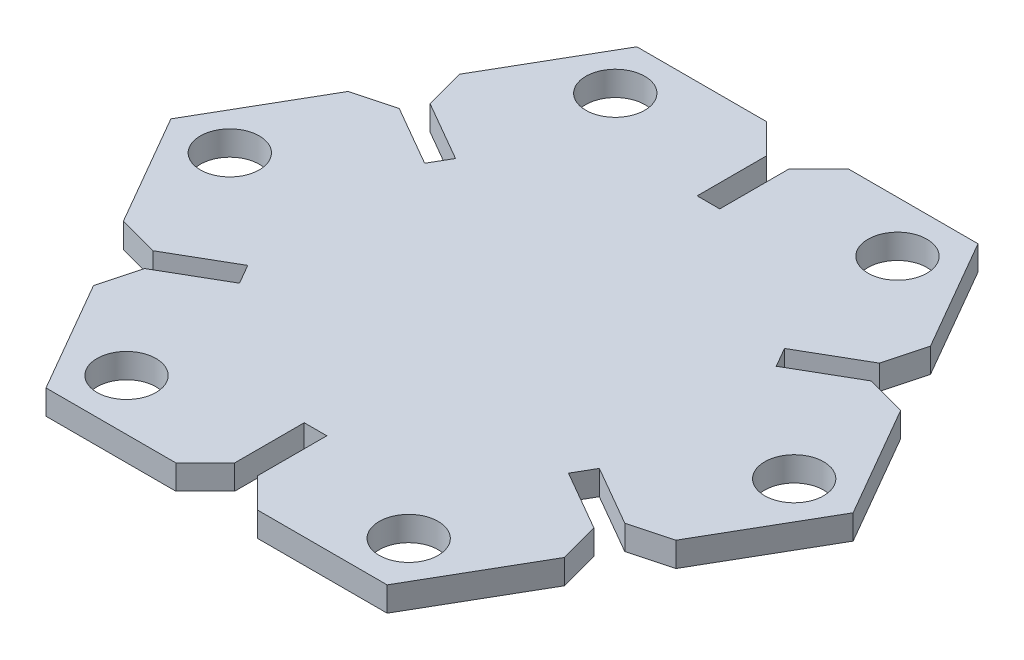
ISO-10303-21;
HEADER;
FILE_DESCRIPTION(('STEP AP214'),'2;1');
FILE_NAME('part.step','',(''),(''),'','','');
FILE_SCHEMA(('AUTOMOTIVE_DESIGN { 1 0 10303 214 1 1 1 1 }'));
ENDSEC;
DATA;
#1=APPLICATION_CONTEXT('core data for automotive mechanical design processes');
#2=APPLICATION_PROTOCOL_DEFINITION('international standard','automotive_design',2000,#1);
#3=PRODUCT_CONTEXT('',#1,'mechanical');
#4=PRODUCT('Part','Part','',(#3));
#5=PRODUCT_RELATED_PRODUCT_CATEGORY('part','',(#4));
#6=PRODUCT_DEFINITION_FORMATION('','',#4);
#7=PRODUCT_DEFINITION_CONTEXT('part definition',#1,'design');
#8=PRODUCT_DEFINITION('design','',#6,#7);
#9=PRODUCT_DEFINITION_SHAPE('','',#8);
#10=(LENGTH_UNIT() NAMED_UNIT(*) SI_UNIT(.MILLI.,.METRE.));
#11=(NAMED_UNIT(*) PLANE_ANGLE_UNIT() SI_UNIT($,.RADIAN.));
#12=(NAMED_UNIT(*) SI_UNIT($,.STERADIAN.) SOLID_ANGLE_UNIT());
#13=UNCERTAINTY_MEASURE_WITH_UNIT(LENGTH_MEASURE(1.E-05),#10,'distance_accuracy_value','');
#14=(GEOMETRIC_REPRESENTATION_CONTEXT(3) GLOBAL_UNCERTAINTY_ASSIGNED_CONTEXT((#13)) GLOBAL_UNIT_ASSIGNED_CONTEXT((#10,
#11,#12)) REPRESENTATION_CONTEXT('',''));
#15=CARTESIAN_POINT('',(0.,0.,0.));
#16=DIRECTION('',(0.,0.,1.));
#17=DIRECTION('',(1.,0.,0.));
#18=AXIS2_PLACEMENT_3D('',#15,#16,#17);
#19=CARTESIAN_POINT('',(0.,1.25,0.));
#20=DIRECTION('',(0.,1.,0.));
#21=DIRECTION('',(0.,0.,1.));
#22=AXIS2_PLACEMENT_3D('',#19,#20,#21);
#23=PLANE('',#22);
#24=CARTESIAN_POINT('',(-28.727618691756,1.25,0.));
#25=DIRECTION('',(0.,1.,0.));
#26=DIRECTION('',(0.,0.,1.));
#27=AXIS2_PLACEMENT_3D('',#24,#25,#26);
#28=CIRCLE('',#27,3.);
#29=CARTESIAN_POINT('',(-28.727618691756,1.25,3.00000000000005));
#30=VERTEX_POINT('',#29);
#31=EDGE_CURVE('E863',#30,#30,#28,.T.);
#32=ORIENTED_EDGE('',*,*,#31,.F.);
#33=EDGE_LOOP('',(#32));
#34=FACE_BOUND('',#33,.T.);
#35=CARTESIAN_POINT('',(14.363809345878,1.25,24.8788475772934));
#36=DIRECTION('',(0.,1.,0.));
#37=DIRECTION('',(0.,0.,1.));
#38=AXIS2_PLACEMENT_3D('',#35,#36,#37);
#39=CIRCLE('',#38,3.);
#40=CARTESIAN_POINT('',(14.363809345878,1.25,27.8788475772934));
#41=VERTEX_POINT('',#40);
#42=EDGE_CURVE('E878',#41,#41,#39,.T.);
#43=ORIENTED_EDGE('',*,*,#42,.F.);
#44=EDGE_LOOP('',(#43));
#45=FACE_BOUND('',#44,.T.);
#46=CARTESIAN_POINT('',(14.363809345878,1.25,-24.8788475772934));
#47=DIRECTION('',(0.,1.,0.));
#48=DIRECTION('',(0.,0.,1.));
#49=AXIS2_PLACEMENT_3D('',#46,#47,#48);
#50=CIRCLE('',#49,2.99999999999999);
#51=CARTESIAN_POINT('',(14.363809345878,1.25,-21.8788475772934));
#52=VERTEX_POINT('',#51);
#53=EDGE_CURVE('E354',#52,#52,#50,.T.);
#54=ORIENTED_EDGE('',*,*,#53,.F.);
#55=EDGE_LOOP('',(#54));
#56=FACE_BOUND('',#55,.T.);
#57=DIRECTION('',(-1.,0.,0.));
#58=VECTOR('',#57,1.);
#59=CARTESIAN_POINT('',(-4.15,1.25,-30.075));
#60=LINE('',#59,#58);
#61=CARTESIAN_POINT('',(-4.15,1.25,-30.075));
#62=VERTEX_POINT('',#61);
#63=CARTESIAN_POINT('',(-17.363809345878,1.25,-30.075));
#64=VERTEX_POINT('',#63);
#65=EDGE_CURVE('E474',#62,#64,#60,.T.);
#66=ORIENTED_EDGE('',*,*,#65,.T.);
#67=DIRECTION('',(-0.499999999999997,0.,0.86602540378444));
#68=VECTOR('',#67,1.);
#69=CARTESIAN_POINT('',(-17.363809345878,1.25,-30.075));
#70=LINE('',#69,#68);
#71=CARTESIAN_POINT('',(-23.970714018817,1.25,-18.6315054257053));
#72=VERTEX_POINT('',#71);
#73=EDGE_CURVE('E205',#64,#72,#70,.T.);
#74=ORIENTED_EDGE('',*,*,#73,.T.);
#75=DIRECTION('',(0.258819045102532,0.,0.965925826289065));
#76=VECTOR('',#75,1.);
#77=CARTESIAN_POINT('',(-22.8726378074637,1.25,-14.5334292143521));
#78=LINE('',#77,#76);
#79=CARTESIAN_POINT('',(-22.8726378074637,1.25,-14.5334292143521));
#80=VERTEX_POINT('',#79);
#81=EDGE_CURVE('E632',#72,#80,#78,.T.);
#82=ORIENTED_EDGE('',*,*,#81,.T.);
#83=DIRECTION('',(0.866025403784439,0.,0.499999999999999));
#84=VECTOR('',#83,1.);
#85=CARTESIAN_POINT('',(-16.7455080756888,1.25,-10.9959292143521));
#86=LINE('',#85,#84);
#87=CARTESIAN_POINT('',(-16.7455080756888,1.25,-10.9959292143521));
#88=VERTEX_POINT('',#87);
#89=EDGE_CURVE('E652',#80,#88,#86,.T.);
#90=ORIENTED_EDGE('',*,*,#89,.T.);
#91=DIRECTION('',(-0.499999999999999,0.,0.866025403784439));
#92=VECTOR('',#91,1.);
#93=CARTESIAN_POINT('',(-17.8955080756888,1.25,-9.00407078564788));
#94=LINE('',#93,#92);
#95=CARTESIAN_POINT('',(-17.8955080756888,1.25,-9.00407078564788));
#96=VERTEX_POINT('',#95);
#97=EDGE_CURVE('E648',#88,#96,#94,.T.);
#98=ORIENTED_EDGE('',*,*,#97,.T.);
#99=DIRECTION('',(-0.866025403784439,0.,-0.5));
#100=VECTOR('',#99,1.);
#101=CARTESIAN_POINT('',(-24.0226378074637,1.25,-12.5415707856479));
#102=LINE('',#101,#100);
#103=CARTESIAN_POINT('',(-24.0226378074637,1.25,-12.5415707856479));
#104=VERTEX_POINT('',#103);
#105=EDGE_CURVE('E651',#96,#104,#102,.T.);
#106=ORIENTED_EDGE('',*,*,#105,.T.);
#107=DIRECTION('',(-0.965925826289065,0.,0.258819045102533));
#108=VECTOR('',#107,1.);
#109=CARTESIAN_POINT('',(-28.120714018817,1.25,-11.4434945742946));
#110=LINE('',#109,#108);
#111=CARTESIAN_POINT('',(-28.120714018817,1.25,-11.4434945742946));
#112=VERTEX_POINT('',#111);
#113=EDGE_CURVE('E657',#104,#112,#110,.T.);
#114=ORIENTED_EDGE('',*,*,#113,.T.);
#115=DIRECTION('',(-0.5,0.,0.866025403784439));
#116=VECTOR('',#115,1.);
#117=CARTESIAN_POINT('',(-28.120714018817,1.25,-11.4434945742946));
#118=LINE('',#117,#116);
#119=CARTESIAN_POINT('',(-34.727618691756,1.25,0.));
#120=VERTEX_POINT('',#119);
#121=EDGE_CURVE('E664',#112,#120,#118,.T.);
#122=ORIENTED_EDGE('',*,*,#121,.T.);
#123=DIRECTION('',(0.500000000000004,0.,0.866025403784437));
#124=VECTOR('',#123,1.);
#125=CARTESIAN_POINT('',(-34.727618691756,1.25,0.));
#126=LINE('',#125,#124);
#127=CARTESIAN_POINT('',(-28.1207140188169,1.25,11.4434945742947));
#128=VERTEX_POINT('',#127);
#129=EDGE_CURVE('E667',#120,#128,#126,.T.);
#130=ORIENTED_EDGE('',*,*,#129,.T.);
#131=DIRECTION('',(0.965925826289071,0.,0.258819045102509));
#132=VECTOR('',#131,1.);
#133=CARTESIAN_POINT('',(-24.0226378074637,1.25,12.5415707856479));
#134=LINE('',#133,#132);
#135=CARTESIAN_POINT('',(-24.0226378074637,1.25,12.5415707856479));
#136=VERTEX_POINT('',#135);
#137=EDGE_CURVE('E670',#128,#136,#134,.T.);
#138=ORIENTED_EDGE('',*,*,#137,.T.);
#139=DIRECTION('',(0.866025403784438,0.,-0.5));
#140=VECTOR('',#139,1.);
#141=CARTESIAN_POINT('',(-17.8955080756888,1.25,9.0040707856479));
#142=LINE('',#141,#140);
#143=CARTESIAN_POINT('',(-17.8955080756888,1.25,9.0040707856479));
#144=VERTEX_POINT('',#143);
#145=EDGE_CURVE('E673',#136,#144,#142,.T.);
#146=ORIENTED_EDGE('',*,*,#145,.T.);
#147=DIRECTION('',(0.500000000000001,0.,0.866025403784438));
#148=VECTOR('',#147,1.);
#149=CARTESIAN_POINT('',(-16.7455080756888,1.25,10.9959292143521));
#150=LINE('',#149,#148);
#151=CARTESIAN_POINT('',(-16.7455080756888,1.25,10.9959292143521));
#152=VERTEX_POINT('',#151);
#153=EDGE_CURVE('E676',#144,#152,#150,.T.);
#154=ORIENTED_EDGE('',*,*,#153,.T.);
#155=DIRECTION('',(-0.866025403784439,0.,0.5));
#156=VECTOR('',#155,1.);
#157=CARTESIAN_POINT('',(-22.8726378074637,1.25,14.5334292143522));
#158=LINE('',#157,#156);
#159=CARTESIAN_POINT('',(-22.8726378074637,1.25,14.5334292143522));
#160=VERTEX_POINT('',#159);
#161=EDGE_CURVE('E679',#152,#160,#158,.T.);
#162=ORIENTED_EDGE('',*,*,#161,.T.);
#163=DIRECTION('',(-0.258819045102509,0.,0.965925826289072));
#164=VECTOR('',#163,1.);
#165=CARTESIAN_POINT('',(-23.970714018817,1.25,18.6315054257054));
#166=LINE('',#165,#164);
#167=CARTESIAN_POINT('',(-23.970714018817,1.25,18.6315054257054));
#168=VERTEX_POINT('',#167);
#169=EDGE_CURVE('E682',#160,#168,#166,.T.);
#170=ORIENTED_EDGE('',*,*,#169,.T.);
#171=DIRECTION('',(0.499999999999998,0.,0.86602540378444));
#172=VECTOR('',#171,1.);
#173=CARTESIAN_POINT('',(-23.970714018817,1.25,18.6315054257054));
#174=LINE('',#173,#172);
#175=CARTESIAN_POINT('',(-17.363809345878,1.25,30.075));
#176=VERTEX_POINT('',#175);
#177=EDGE_CURVE('E685',#168,#176,#174,.T.);
#178=ORIENTED_EDGE('',*,*,#177,.T.);
#179=DIRECTION('',(1.,0.,0.));
#180=VECTOR('',#179,1.);
#181=CARTESIAN_POINT('',(-17.363809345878,1.25,30.075));
#182=LINE('',#181,#180);
#183=CARTESIAN_POINT('',(-4.14999999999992,1.25,30.075));
#184=VERTEX_POINT('',#183);
#185=EDGE_CURVE('E688',#176,#184,#182,.T.);
#186=ORIENTED_EDGE('',*,*,#185,.T.);
#187=DIRECTION('',(0.707106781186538,0.,-0.707106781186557));
#188=VECTOR('',#187,1.);
#189=CARTESIAN_POINT('',(-1.15,1.25,27.075));
#190=LINE('',#189,#188);
#191=CARTESIAN_POINT('',(-1.15,1.25,27.075));
#192=VERTEX_POINT('',#191);
#193=EDGE_CURVE('E691',#184,#192,#190,.T.);
#194=ORIENTED_EDGE('',*,*,#193,.T.);
#195=DIRECTION('',(0.,0.,-1.));
#196=VECTOR('',#195,1.);
#197=CARTESIAN_POINT('',(-1.15,1.25,20.));
#198=LINE('',#197,#196);
#199=CARTESIAN_POINT('',(-1.15,1.25,20.));
#200=VERTEX_POINT('',#199);
#201=EDGE_CURVE('E694',#192,#200,#198,.T.);
#202=ORIENTED_EDGE('',*,*,#201,.T.);
#203=DIRECTION('',(1.,0.,0.));
#204=VECTOR('',#203,1.);
#205=CARTESIAN_POINT('',(1.15,1.25,20.));
#206=LINE('',#205,#204);
#207=CARTESIAN_POINT('',(1.15,1.25,20.));
#208=VERTEX_POINT('',#207);
#209=EDGE_CURVE('E697',#200,#208,#206,.T.);
#210=ORIENTED_EDGE('',*,*,#209,.T.);
#211=DIRECTION('',(0.,0.,1.));
#212=VECTOR('',#211,1.);
#213=CARTESIAN_POINT('',(1.15,1.25,27.0750000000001));
#214=LINE('',#213,#212);
#215=CARTESIAN_POINT('',(1.15,1.25,27.0750000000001));
#216=VERTEX_POINT('',#215);
#217=EDGE_CURVE('E700',#208,#216,#214,.T.);
#218=ORIENTED_EDGE('',*,*,#217,.T.);
#219=DIRECTION('',(0.707106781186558,0.,0.707106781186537));
#220=VECTOR('',#219,1.);
#221=CARTESIAN_POINT('',(4.15000000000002,1.25,30.075));
#222=LINE('',#221,#220);
#223=CARTESIAN_POINT('',(4.15000000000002,1.25,30.075));
#224=VERTEX_POINT('',#223);
#225=EDGE_CURVE('E703',#216,#224,#222,.T.);
#226=ORIENTED_EDGE('',*,*,#225,.T.);
#227=DIRECTION('',(1.,0.,0.));
#228=VECTOR('',#227,1.);
#229=CARTESIAN_POINT('',(4.15000000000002,1.25,30.075));
#230=LINE('',#229,#228);
#231=CARTESIAN_POINT('',(17.363809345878,1.25,30.075));
#232=VERTEX_POINT('',#231);
#233=EDGE_CURVE('E706',#224,#232,#230,.T.);
#234=ORIENTED_EDGE('',*,*,#233,.T.);
#235=DIRECTION('',(0.499999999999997,0.,-0.86602540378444));
#236=VECTOR('',#235,1.);
#237=CARTESIAN_POINT('',(17.363809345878,1.25,30.075));
#238=LINE('',#237,#236);
#239=CARTESIAN_POINT('',(23.970714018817,1.25,18.6315054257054));
#240=VERTEX_POINT('',#239);
#241=EDGE_CURVE('E709',#232,#240,#238,.T.);
#242=ORIENTED_EDGE('',*,*,#241,.T.);
#243=DIRECTION('',(-0.258819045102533,0.,-0.965925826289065));
#244=VECTOR('',#243,1.);
#245=CARTESIAN_POINT('',(22.8726378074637,1.25,14.5334292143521));
#246=LINE('',#245,#244);
#247=CARTESIAN_POINT('',(22.8726378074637,1.25,14.5334292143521));
#248=VERTEX_POINT('',#247);
#249=EDGE_CURVE('E712',#240,#248,#246,.T.);
#250=ORIENTED_EDGE('',*,*,#249,.T.);
#251=DIRECTION('',(-0.866025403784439,0.,-0.5));
#252=VECTOR('',#251,1.);
#253=CARTESIAN_POINT('',(16.7455080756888,1.25,10.9959292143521));
#254=LINE('',#253,#252);
#255=CARTESIAN_POINT('',(16.7455080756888,1.25,10.9959292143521));
#256=VERTEX_POINT('',#255);
#257=EDGE_CURVE('E715',#248,#256,#254,.T.);
#258=ORIENTED_EDGE('',*,*,#257,.T.);
#259=DIRECTION('',(0.500000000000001,0.,-0.866025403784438));
#260=VECTOR('',#259,1.);
#261=CARTESIAN_POINT('',(17.8955080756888,1.25,9.00407078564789));
#262=LINE('',#261,#260);
#263=CARTESIAN_POINT('',(17.8955080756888,1.25,9.00407078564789));
#264=VERTEX_POINT('',#263);
#265=EDGE_CURVE('E718',#256,#264,#262,.T.);
#266=ORIENTED_EDGE('',*,*,#265,.T.);
#267=DIRECTION('',(0.866025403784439,0.,0.5));
#268=VECTOR('',#267,1.);
#269=CARTESIAN_POINT('',(24.0226378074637,1.25,12.5415707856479));
#270=LINE('',#269,#268);
#271=CARTESIAN_POINT('',(24.0226378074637,1.25,12.5415707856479));
#272=VERTEX_POINT('',#271);
#273=EDGE_CURVE('E721',#264,#272,#270,.T.);
#274=ORIENTED_EDGE('',*,*,#273,.T.);
#275=DIRECTION('',(0.965925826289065,0.,-0.258819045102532));
#276=VECTOR('',#275,1.);
#277=CARTESIAN_POINT('',(28.120714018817,1.25,11.4434945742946));
#278=LINE('',#277,#276);
#279=CARTESIAN_POINT('',(28.120714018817,1.25,11.4434945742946));
#280=VERTEX_POINT('',#279);
#281=EDGE_CURVE('E724',#272,#280,#278,.T.);
#282=ORIENTED_EDGE('',*,*,#281,.T.);
#283=DIRECTION('',(0.5,0.,-0.866025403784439));
#284=VECTOR('',#283,1.);
#285=CARTESIAN_POINT('',(28.120714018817,1.25,11.4434945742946));
#286=LINE('',#285,#284);
#287=CARTESIAN_POINT('',(34.727618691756,1.25,0.));
#288=VERTEX_POINT('',#287);
#289=EDGE_CURVE('E727',#280,#288,#286,.T.);
#290=ORIENTED_EDGE('',*,*,#289,.T.);
#291=DIRECTION('',(-0.500000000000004,0.,-0.866025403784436));
#292=VECTOR('',#291,1.);
#293=CARTESIAN_POINT('',(34.727618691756,1.25,0.));
#294=LINE('',#293,#292);
#295=CARTESIAN_POINT('',(28.120714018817,1.25,-11.4434945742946));
#296=VERTEX_POINT('',#295);
#297=EDGE_CURVE('E730',#288,#296,#294,.T.);
#298=ORIENTED_EDGE('',*,*,#297,.T.);
#299=DIRECTION('',(-0.965925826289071,0.,-0.25881904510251));
#300=VECTOR('',#299,1.);
#301=CARTESIAN_POINT('',(24.0226378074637,1.25,-12.5415707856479));
#302=LINE('',#301,#300);
#303=CARTESIAN_POINT('',(24.0226378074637,1.25,-12.5415707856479));
#304=VERTEX_POINT('',#303);
#305=EDGE_CURVE('E733',#296,#304,#302,.T.);
#306=ORIENTED_EDGE('',*,*,#305,.T.);
#307=DIRECTION('',(-0.866025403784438,0.,0.5));
#308=VECTOR('',#307,1.);
#309=CARTESIAN_POINT('',(17.8955080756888,1.25,-9.0040707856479));
#310=LINE('',#309,#308);
#311=CARTESIAN_POINT('',(17.8955080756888,1.25,-9.0040707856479));
#312=VERTEX_POINT('',#311);
#313=EDGE_CURVE('E736',#304,#312,#310,.T.);
#314=ORIENTED_EDGE('',*,*,#313,.T.);
#315=DIRECTION('',(-0.500000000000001,0.,-0.866025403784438));
#316=VECTOR('',#315,1.);
#317=CARTESIAN_POINT('',(16.7455080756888,1.25,-10.9959292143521));
#318=LINE('',#317,#316);
#319=CARTESIAN_POINT('',(16.7455080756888,1.25,-10.9959292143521));
#320=VERTEX_POINT('',#319);
#321=EDGE_CURVE('E739',#312,#320,#318,.T.);
#322=ORIENTED_EDGE('',*,*,#321,.T.);
#323=DIRECTION('',(0.866025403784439,0.,-0.5));
#324=VECTOR('',#323,1.);
#325=CARTESIAN_POINT('',(22.8726378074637,1.25,-14.5334292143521));
#326=LINE('',#325,#324);
#327=CARTESIAN_POINT('',(22.8726378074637,1.25,-14.5334292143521));
#328=VERTEX_POINT('',#327);
#329=EDGE_CURVE('E742',#320,#328,#326,.T.);
#330=ORIENTED_EDGE('',*,*,#329,.T.);
#331=DIRECTION('',(0.258819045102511,0.,-0.965925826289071));
#332=VECTOR('',#331,1.);
#333=CARTESIAN_POINT('',(23.970714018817,1.25,-18.6315054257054));
#334=LINE('',#333,#332);
#335=CARTESIAN_POINT('',(23.970714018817,1.25,-18.6315054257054));
#336=VERTEX_POINT('',#335);
#337=EDGE_CURVE('E745',#328,#336,#334,.T.);
#338=ORIENTED_EDGE('',*,*,#337,.T.);
#339=DIRECTION('',(-0.5,0.,-0.866025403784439));
#340=VECTOR('',#339,1.);
#341=CARTESIAN_POINT('',(23.970714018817,1.25,-18.6315054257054));
#342=LINE('',#341,#340);
#343=CARTESIAN_POINT('',(17.363809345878,1.25,-30.075));
#344=VERTEX_POINT('',#343);
#345=EDGE_CURVE('E748',#336,#344,#342,.T.);
#346=ORIENTED_EDGE('',*,*,#345,.T.);
#347=DIRECTION('',(-1.,0.,0.));
#348=VECTOR('',#347,1.);
#349=CARTESIAN_POINT('',(17.363809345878,1.25,-30.075));
#350=LINE('',#349,#348);
#351=CARTESIAN_POINT('',(4.14999999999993,1.25,-30.075));
#352=VERTEX_POINT('',#351);
#353=EDGE_CURVE('E751',#344,#352,#350,.T.);
#354=ORIENTED_EDGE('',*,*,#353,.T.);
#355=DIRECTION('',(-0.707106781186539,0.,0.707106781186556));
#356=VECTOR('',#355,1.);
#357=CARTESIAN_POINT('',(1.15,1.25,-27.075));
#358=LINE('',#357,#356);
#359=CARTESIAN_POINT('',(1.15,1.25,-27.075));
#360=VERTEX_POINT('',#359);
#361=EDGE_CURVE('E754',#352,#360,#358,.T.);
#362=ORIENTED_EDGE('',*,*,#361,.T.);
#363=DIRECTION('',(0.,0.,1.));
#364=VECTOR('',#363,1.);
#365=CARTESIAN_POINT('',(1.15,1.25,-20.));
#366=LINE('',#365,#364);
#367=CARTESIAN_POINT('',(1.15,1.25,-20.));
#368=VERTEX_POINT('',#367);
#369=EDGE_CURVE('E326',#360,#368,#366,.T.);
#370=ORIENTED_EDGE('',*,*,#369,.T.);
#371=DIRECTION('',(-1.,0.,0.));
#372=VECTOR('',#371,1.);
#373=CARTESIAN_POINT('',(-1.15,1.25,-20.));
#374=LINE('',#373,#372);
#375=CARTESIAN_POINT('',(-1.15,1.25,-20.));
#376=VERTEX_POINT('',#375);
#377=EDGE_CURVE('E320',#368,#376,#374,.T.);
#378=ORIENTED_EDGE('',*,*,#377,.T.);
#379=DIRECTION('',(0.,0.,-1.));
#380=VECTOR('',#379,1.);
#381=CARTESIAN_POINT('',(-1.15,1.25,-27.0750000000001));
#382=LINE('',#381,#380);
#383=CARTESIAN_POINT('',(-1.15,1.25,-27.0750000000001));
#384=VERTEX_POINT('',#383);
#385=EDGE_CURVE('E324',#376,#384,#382,.T.);
#386=ORIENTED_EDGE('',*,*,#385,.T.);
#387=DIRECTION('',(-0.707106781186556,0.,-0.707106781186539));
#388=VECTOR('',#387,1.);
#389=CARTESIAN_POINT('',(-4.15,1.25,-30.075));
#390=LINE('',#389,#388);
#391=EDGE_CURVE('E60',#384,#62,#390,.T.);
#392=ORIENTED_EDGE('',*,*,#391,.T.);
#393=EDGE_LOOP('',(#66,#74,#82,#90,#98,#106,#114,#122,#130,#138,#146,#154,#162,#170,#178,#186,
#194,#202,#210,#218,#226,#234,#242,#250,#258,#266,#274,#282,#290,#298,#306,#314,#322,#330,#338,
#346,#354,#362,#370,#378,#386,#392));
#394=FACE_BOUND('',#393,.T.);
#395=CARTESIAN_POINT('',(28.727618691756,1.25,0.));
#396=DIRECTION('',(0.,1.,0.));
#397=DIRECTION('',(0.,0.,1.));
#398=AXIS2_PLACEMENT_3D('',#395,#396,#397);
#399=CIRCLE('',#398,3.);
#400=CARTESIAN_POINT('',(28.727618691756,1.25,2.99999999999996));
#401=VERTEX_POINT('',#400);
#402=EDGE_CURVE('E886',#401,#401,#399,.T.);
#403=ORIENTED_EDGE('',*,*,#402,.F.);
#404=EDGE_LOOP('',(#403));
#405=FACE_BOUND('',#404,.T.);
#406=CARTESIAN_POINT('',(-14.363809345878,1.25,24.8788475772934));
#407=DIRECTION('',(0.,1.,0.));
#408=DIRECTION('',(0.,0.,1.));
#409=AXIS2_PLACEMENT_3D('',#406,#407,#408);
#410=CIRCLE('',#409,3.);
#411=CARTESIAN_POINT('',(-14.363809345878,1.25,27.8788475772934));
#412=VERTEX_POINT('',#411);
#413=EDGE_CURVE('E870',#412,#412,#410,.T.);
#414=ORIENTED_EDGE('',*,*,#413,.F.);
#415=EDGE_LOOP('',(#414));
#416=FACE_BOUND('',#415,.T.);
#417=CARTESIAN_POINT('',(-14.363809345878,1.25,-24.8788475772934));
#418=DIRECTION('',(0.,1.,0.));
#419=DIRECTION('',(0.,0.,1.));
#420=AXIS2_PLACEMENT_3D('',#417,#418,#419);
#421=CIRCLE('',#420,3.);
#422=CARTESIAN_POINT('',(-14.363809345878,1.25,-21.8788475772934));
#423=VERTEX_POINT('',#422);
#424=EDGE_CURVE('E850',#423,#423,#421,.T.);
#425=ORIENTED_EDGE('',*,*,#424,.F.);
#426=EDGE_LOOP('',(#425));
#427=FACE_BOUND('',#426,.T.);
#428=ADVANCED_FACE('F42',(#34,#45,#56,#394,#405,#416,#427),#23,.T.);
#429=CARTESIAN_POINT('',(0.,-1.25,0.));
#430=DIRECTION('',(0.,1.,0.));
#431=DIRECTION('',(0.,0.,1.));
#432=AXIS2_PLACEMENT_3D('',#429,#430,#431);
#433=PLANE('',#432);
#434=DIRECTION('',(-1.,0.,0.));
#435=VECTOR('',#434,1.);
#436=CARTESIAN_POINT('',(-4.15,-1.25,-30.075));
#437=LINE('',#436,#435);
#438=CARTESIAN_POINT('',(-4.15,-1.25,-30.075));
#439=VERTEX_POINT('',#438);
#440=CARTESIAN_POINT('',(-17.363809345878,-1.25,-30.075));
#441=VERTEX_POINT('',#440);
#442=EDGE_CURVE('E349',#439,#441,#437,.T.);
#443=ORIENTED_EDGE('',*,*,#442,.F.);
#444=DIRECTION('',(-0.707106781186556,0.,-0.707106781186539));
#445=VECTOR('',#444,1.);
#446=CARTESIAN_POINT('',(-4.15,-1.25,-30.075));
#447=LINE('',#446,#445);
#448=CARTESIAN_POINT('',(-1.15,-1.25,-27.0750000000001));
#449=VERTEX_POINT('',#448);
#450=EDGE_CURVE('E197',#449,#439,#447,.T.);
#451=ORIENTED_EDGE('',*,*,#450,.F.);
#452=DIRECTION('',(0.,0.,-1.));
#453=VECTOR('',#452,1.);
#454=CARTESIAN_POINT('',(-1.15,-1.25,-27.0750000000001));
#455=LINE('',#454,#453);
#456=CARTESIAN_POINT('',(-1.15,-1.25,-20.));
#457=VERTEX_POINT('',#456);
#458=EDGE_CURVE('E191',#457,#449,#455,.T.);
#459=ORIENTED_EDGE('',*,*,#458,.F.);
#460=DIRECTION('',(-1.,0.,0.));
#461=VECTOR('',#460,1.);
#462=CARTESIAN_POINT('',(-1.15,-1.25,-20.));
#463=LINE('',#462,#461);
#464=CARTESIAN_POINT('',(1.15,-1.25,-20.));
#465=VERTEX_POINT('',#464);
#466=EDGE_CURVE('E335',#465,#457,#463,.T.);
#467=ORIENTED_EDGE('',*,*,#466,.F.);
#468=DIRECTION('',(0.,0.,1.));
#469=VECTOR('',#468,1.);
#470=CARTESIAN_POINT('',(1.15,-1.25,-20.));
#471=LINE('',#470,#469);
#472=CARTESIAN_POINT('',(1.15,-1.25,-27.075));
#473=VERTEX_POINT('',#472);
#474=EDGE_CURVE('E465',#473,#465,#471,.T.);
#475=ORIENTED_EDGE('',*,*,#474,.F.);
#476=DIRECTION('',(-0.707106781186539,0.,0.707106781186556));
#477=VECTOR('',#476,1.);
#478=CARTESIAN_POINT('',(1.15,-1.25,-27.075));
#479=LINE('',#478,#477);
#480=CARTESIAN_POINT('',(4.14999999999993,-1.25,-30.075));
#481=VERTEX_POINT('',#480);
#482=EDGE_CURVE('E462',#481,#473,#479,.T.);
#483=ORIENTED_EDGE('',*,*,#482,.F.);
#484=DIRECTION('',(-1.,0.,0.));
#485=VECTOR('',#484,1.);
#486=CARTESIAN_POINT('',(17.363809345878,-1.25,-30.075));
#487=LINE('',#486,#485);
#488=CARTESIAN_POINT('',(17.363809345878,-1.25,-30.075));
#489=VERTEX_POINT('',#488);
#490=EDGE_CURVE('E459',#489,#481,#487,.T.);
#491=ORIENTED_EDGE('',*,*,#490,.F.);
#492=DIRECTION('',(-0.5,0.,-0.866025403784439));
#493=VECTOR('',#492,1.);
#494=CARTESIAN_POINT('',(23.970714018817,-1.25,-18.6315054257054));
#495=LINE('',#494,#493);
#496=CARTESIAN_POINT('',(23.970714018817,-1.25,-18.6315054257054));
#497=VERTEX_POINT('',#496);
#498=EDGE_CURVE('E456',#497,#489,#495,.T.);
#499=ORIENTED_EDGE('',*,*,#498,.F.);
#500=DIRECTION('',(0.258819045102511,0.,-0.965925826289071));
#501=VECTOR('',#500,1.);
#502=CARTESIAN_POINT('',(23.970714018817,-1.25,-18.6315054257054));
#503=LINE('',#502,#501);
#504=CARTESIAN_POINT('',(22.8726378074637,-1.25,-14.5334292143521));
#505=VERTEX_POINT('',#504);
#506=EDGE_CURVE('E453',#505,#497,#503,.T.);
#507=ORIENTED_EDGE('',*,*,#506,.F.);
#508=DIRECTION('',(0.866025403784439,0.,-0.5));
#509=VECTOR('',#508,1.);
#510=CARTESIAN_POINT('',(22.8726378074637,-1.25,-14.5334292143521));
#511=LINE('',#510,#509);
#512=CARTESIAN_POINT('',(16.7455080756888,-1.25,-10.9959292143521));
#513=VERTEX_POINT('',#512);
#514=EDGE_CURVE('E450',#513,#505,#511,.T.);
#515=ORIENTED_EDGE('',*,*,#514,.F.);
#516=DIRECTION('',(-0.500000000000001,0.,-0.866025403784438));
#517=VECTOR('',#516,1.);
#518=CARTESIAN_POINT('',(16.7455080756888,-1.25,-10.9959292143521));
#519=LINE('',#518,#517);
#520=CARTESIAN_POINT('',(17.8955080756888,-1.25,-9.0040707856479));
#521=VERTEX_POINT('',#520);
#522=EDGE_CURVE('E447',#521,#513,#519,.T.);
#523=ORIENTED_EDGE('',*,*,#522,.F.);
#524=DIRECTION('',(-0.866025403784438,0.,0.5));
#525=VECTOR('',#524,1.);
#526=CARTESIAN_POINT('',(17.8955080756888,-1.25,-9.0040707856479));
#527=LINE('',#526,#525);
#528=CARTESIAN_POINT('',(24.0226378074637,-1.25,-12.5415707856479));
#529=VERTEX_POINT('',#528);
#530=EDGE_CURVE('E444',#529,#521,#527,.T.);
#531=ORIENTED_EDGE('',*,*,#530,.F.);
#532=DIRECTION('',(-0.965925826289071,0.,-0.25881904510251));
#533=VECTOR('',#532,1.);
#534=CARTESIAN_POINT('',(24.0226378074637,-1.25,-12.5415707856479));
#535=LINE('',#534,#533);
#536=CARTESIAN_POINT('',(28.120714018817,-1.25,-11.4434945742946));
#537=VERTEX_POINT('',#536);
#538=EDGE_CURVE('E441',#537,#529,#535,.T.);
#539=ORIENTED_EDGE('',*,*,#538,.F.);
#540=DIRECTION('',(-0.500000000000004,0.,-0.866025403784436));
#541=VECTOR('',#540,1.);
#542=CARTESIAN_POINT('',(34.727618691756,-1.25,0.));
#543=LINE('',#542,#541);
#544=CARTESIAN_POINT('',(34.727618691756,-1.25,0.));
#545=VERTEX_POINT('',#544);
#546=EDGE_CURVE('E438',#545,#537,#543,.T.);
#547=ORIENTED_EDGE('',*,*,#546,.F.);
#548=DIRECTION('',(0.5,0.,-0.866025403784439));
#549=VECTOR('',#548,1.);
#550=CARTESIAN_POINT('',(28.120714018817,-1.25,11.4434945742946));
#551=LINE('',#550,#549);
#552=CARTESIAN_POINT('',(28.120714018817,-1.25,11.4434945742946));
#553=VERTEX_POINT('',#552);
#554=EDGE_CURVE('E435',#553,#545,#551,.T.);
#555=ORIENTED_EDGE('',*,*,#554,.F.);
#556=DIRECTION('',(0.965925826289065,0.,-0.258819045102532));
#557=VECTOR('',#556,1.);
#558=CARTESIAN_POINT('',(28.120714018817,-1.25,11.4434945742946));
#559=LINE('',#558,#557);
#560=CARTESIAN_POINT('',(24.0226378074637,-1.25,12.5415707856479));
#561=VERTEX_POINT('',#560);
#562=EDGE_CURVE('E432',#561,#553,#559,.T.);
#563=ORIENTED_EDGE('',*,*,#562,.F.);
#564=DIRECTION('',(0.866025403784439,0.,0.5));
#565=VECTOR('',#564,1.);
#566=CARTESIAN_POINT('',(24.0226378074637,-1.25,12.5415707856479));
#567=LINE('',#566,#565);
#568=CARTESIAN_POINT('',(17.8955080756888,-1.25,9.00407078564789));
#569=VERTEX_POINT('',#568);
#570=EDGE_CURVE('E429',#569,#561,#567,.T.);
#571=ORIENTED_EDGE('',*,*,#570,.F.);
#572=DIRECTION('',(0.500000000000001,0.,-0.866025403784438));
#573=VECTOR('',#572,1.);
#574=CARTESIAN_POINT('',(17.8955080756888,-1.25,9.00407078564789));
#575=LINE('',#574,#573);
#576=CARTESIAN_POINT('',(16.7455080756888,-1.25,10.9959292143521));
#577=VERTEX_POINT('',#576);
#578=EDGE_CURVE('E426',#577,#569,#575,.T.);
#579=ORIENTED_EDGE('',*,*,#578,.F.);
#580=DIRECTION('',(-0.866025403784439,0.,-0.5));
#581=VECTOR('',#580,1.);
#582=CARTESIAN_POINT('',(16.7455080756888,-1.25,10.9959292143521));
#583=LINE('',#582,#581);
#584=CARTESIAN_POINT('',(22.8726378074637,-1.25,14.5334292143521));
#585=VERTEX_POINT('',#584);
#586=EDGE_CURVE('E423',#585,#577,#583,.T.);
#587=ORIENTED_EDGE('',*,*,#586,.F.);
#588=DIRECTION('',(-0.258819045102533,0.,-0.965925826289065));
#589=VECTOR('',#588,1.);
#590=CARTESIAN_POINT('',(22.8726378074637,-1.25,14.5334292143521));
#591=LINE('',#590,#589);
#592=CARTESIAN_POINT('',(23.970714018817,-1.25,18.6315054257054));
#593=VERTEX_POINT('',#592);
#594=EDGE_CURVE('E420',#593,#585,#591,.T.);
#595=ORIENTED_EDGE('',*,*,#594,.F.);
#596=DIRECTION('',(0.499999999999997,0.,-0.86602540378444));
#597=VECTOR('',#596,1.);
#598=CARTESIAN_POINT('',(17.363809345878,-1.25,30.075));
#599=LINE('',#598,#597);
#600=CARTESIAN_POINT('',(17.363809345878,-1.25,30.075));
#601=VERTEX_POINT('',#600);
#602=EDGE_CURVE('E417',#601,#593,#599,.T.);
#603=ORIENTED_EDGE('',*,*,#602,.F.);
#604=DIRECTION('',(1.,0.,0.));
#605=VECTOR('',#604,1.);
#606=CARTESIAN_POINT('',(4.15000000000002,-1.25,30.075));
#607=LINE('',#606,#605);
#608=CARTESIAN_POINT('',(4.15000000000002,-1.25,30.075));
#609=VERTEX_POINT('',#608);
#610=EDGE_CURVE('E414',#609,#601,#607,.T.);
#611=ORIENTED_EDGE('',*,*,#610,.F.);
#612=DIRECTION('',(0.707106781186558,0.,0.707106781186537));
#613=VECTOR('',#612,1.);
#614=CARTESIAN_POINT('',(4.15000000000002,-1.25,30.075));
#615=LINE('',#614,#613);
#616=CARTESIAN_POINT('',(1.15,-1.25,27.0750000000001));
#617=VERTEX_POINT('',#616);
#618=EDGE_CURVE('E411',#617,#609,#615,.T.);
#619=ORIENTED_EDGE('',*,*,#618,.F.);
#620=DIRECTION('',(0.,0.,1.));
#621=VECTOR('',#620,1.);
#622=CARTESIAN_POINT('',(1.15,-1.25,27.0750000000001));
#623=LINE('',#622,#621);
#624=CARTESIAN_POINT('',(1.15,-1.25,20.));
#625=VERTEX_POINT('',#624);
#626=EDGE_CURVE('E408',#625,#617,#623,.T.);
#627=ORIENTED_EDGE('',*,*,#626,.F.);
#628=DIRECTION('',(1.,0.,0.));
#629=VECTOR('',#628,1.);
#630=CARTESIAN_POINT('',(1.15,-1.25,20.));
#631=LINE('',#630,#629);
#632=CARTESIAN_POINT('',(-1.15,-1.25,20.));
#633=VERTEX_POINT('',#632);
#634=EDGE_CURVE('E405',#633,#625,#631,.T.);
#635=ORIENTED_EDGE('',*,*,#634,.F.);
#636=DIRECTION('',(0.,0.,-1.));
#637=VECTOR('',#636,1.);
#638=CARTESIAN_POINT('',(-1.15,-1.25,20.));
#639=LINE('',#638,#637);
#640=CARTESIAN_POINT('',(-1.15,-1.25,27.075));
#641=VERTEX_POINT('',#640);
#642=EDGE_CURVE('E402',#641,#633,#639,.T.);
#643=ORIENTED_EDGE('',*,*,#642,.F.);
#644=DIRECTION('',(0.707106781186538,0.,-0.707106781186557));
#645=VECTOR('',#644,1.);
#646=CARTESIAN_POINT('',(-1.15,-1.25,27.075));
#647=LINE('',#646,#645);
#648=CARTESIAN_POINT('',(-4.14999999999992,-1.25,30.075));
#649=VERTEX_POINT('',#648);
#650=EDGE_CURVE('E399',#649,#641,#647,.T.);
#651=ORIENTED_EDGE('',*,*,#650,.F.);
#652=DIRECTION('',(1.,0.,0.));
#653=VECTOR('',#652,1.);
#654=CARTESIAN_POINT('',(-17.363809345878,-1.25,30.075));
#655=LINE('',#654,#653);
#656=CARTESIAN_POINT('',(-17.363809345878,-1.25,30.075));
#657=VERTEX_POINT('',#656);
#658=EDGE_CURVE('E396',#657,#649,#655,.T.);
#659=ORIENTED_EDGE('',*,*,#658,.F.);
#660=DIRECTION('',(0.499999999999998,0.,0.86602540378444));
#661=VECTOR('',#660,1.);
#662=CARTESIAN_POINT('',(-23.970714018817,-1.25,18.6315054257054));
#663=LINE('',#662,#661);
#664=CARTESIAN_POINT('',(-23.970714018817,-1.25,18.6315054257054));
#665=VERTEX_POINT('',#664);
#666=EDGE_CURVE('E393',#665,#657,#663,.T.);
#667=ORIENTED_EDGE('',*,*,#666,.F.);
#668=DIRECTION('',(-0.258819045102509,0.,0.965925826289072));
#669=VECTOR('',#668,1.);
#670=CARTESIAN_POINT('',(-23.970714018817,-1.25,18.6315054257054));
#671=LINE('',#670,#669);
#672=CARTESIAN_POINT('',(-22.8726378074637,-1.25,14.5334292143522));
#673=VERTEX_POINT('',#672);
#674=EDGE_CURVE('E390',#673,#665,#671,.T.);
#675=ORIENTED_EDGE('',*,*,#674,.F.);
#676=DIRECTION('',(-0.866025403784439,0.,0.5));
#677=VECTOR('',#676,1.);
#678=CARTESIAN_POINT('',(-22.8726378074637,-1.25,14.5334292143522));
#679=LINE('',#678,#677);
#680=CARTESIAN_POINT('',(-16.7455080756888,-1.25,10.9959292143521));
#681=VERTEX_POINT('',#680);
#682=EDGE_CURVE('E387',#681,#673,#679,.T.);
#683=ORIENTED_EDGE('',*,*,#682,.F.);
#684=DIRECTION('',(0.500000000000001,0.,0.866025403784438));
#685=VECTOR('',#684,1.);
#686=CARTESIAN_POINT('',(-16.7455080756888,-1.25,10.9959292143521));
#687=LINE('',#686,#685);
#688=CARTESIAN_POINT('',(-17.8955080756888,-1.25,9.0040707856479));
#689=VERTEX_POINT('',#688);
#690=EDGE_CURVE('E384',#689,#681,#687,.T.);
#691=ORIENTED_EDGE('',*,*,#690,.F.);
#692=DIRECTION('',(0.866025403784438,0.,-0.5));
#693=VECTOR('',#692,1.);
#694=CARTESIAN_POINT('',(-17.8955080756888,-1.25,9.0040707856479));
#695=LINE('',#694,#693);
#696=CARTESIAN_POINT('',(-24.0226378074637,-1.25,12.5415707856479));
#697=VERTEX_POINT('',#696);
#698=EDGE_CURVE('E381',#697,#689,#695,.T.);
#699=ORIENTED_EDGE('',*,*,#698,.F.);
#700=DIRECTION('',(0.965925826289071,0.,0.258819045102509));
#701=VECTOR('',#700,1.);
#702=CARTESIAN_POINT('',(-24.0226378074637,-1.25,12.5415707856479));
#703=LINE('',#702,#701);
#704=CARTESIAN_POINT('',(-28.1207140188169,-1.25,11.4434945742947));
#705=VERTEX_POINT('',#704);
#706=EDGE_CURVE('E378',#705,#697,#703,.T.);
#707=ORIENTED_EDGE('',*,*,#706,.F.);
#708=DIRECTION('',(0.500000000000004,0.,0.866025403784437));
#709=VECTOR('',#708,1.);
#710=CARTESIAN_POINT('',(-34.727618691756,-1.25,0.));
#711=LINE('',#710,#709);
#712=CARTESIAN_POINT('',(-34.727618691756,-1.25,0.));
#713=VERTEX_POINT('',#712);
#714=EDGE_CURVE('E375',#713,#705,#711,.T.);
#715=ORIENTED_EDGE('',*,*,#714,.F.);
#716=DIRECTION('',(-0.5,0.,0.866025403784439));
#717=VECTOR('',#716,1.);
#718=CARTESIAN_POINT('',(-28.120714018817,-1.25,-11.4434945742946));
#719=LINE('',#718,#717);
#720=CARTESIAN_POINT('',(-28.120714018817,-1.25,-11.4434945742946));
#721=VERTEX_POINT('',#720);
#722=EDGE_CURVE('E372',#721,#713,#719,.T.);
#723=ORIENTED_EDGE('',*,*,#722,.F.);
#724=DIRECTION('',(-0.965925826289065,0.,0.258819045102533));
#725=VECTOR('',#724,1.);
#726=CARTESIAN_POINT('',(-28.120714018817,-1.25,-11.4434945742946));
#727=LINE('',#726,#725);
#728=CARTESIAN_POINT('',(-24.0226378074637,-1.25,-12.5415707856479));
#729=VERTEX_POINT('',#728);
#730=EDGE_CURVE('E369',#729,#721,#727,.T.);
#731=ORIENTED_EDGE('',*,*,#730,.F.);
#732=DIRECTION('',(-0.866025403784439,0.,-0.5));
#733=VECTOR('',#732,1.);
#734=CARTESIAN_POINT('',(-24.0226378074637,-1.25,-12.5415707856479));
#735=LINE('',#734,#733);
#736=CARTESIAN_POINT('',(-17.8955080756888,-1.25,-9.00407078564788));
#737=VERTEX_POINT('',#736);
#738=EDGE_CURVE('E366',#737,#729,#735,.T.);
#739=ORIENTED_EDGE('',*,*,#738,.F.);
#740=DIRECTION('',(-0.499999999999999,0.,0.866025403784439));
#741=VECTOR('',#740,1.);
#742=CARTESIAN_POINT('',(-17.8955080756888,-1.25,-9.00407078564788));
#743=LINE('',#742,#741);
#744=CARTESIAN_POINT('',(-16.7455080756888,-1.25,-10.9959292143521));
#745=VERTEX_POINT('',#744);
#746=EDGE_CURVE('E363',#745,#737,#743,.T.);
#747=ORIENTED_EDGE('',*,*,#746,.F.);
#748=DIRECTION('',(0.866025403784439,0.,0.499999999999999));
#749=VECTOR('',#748,1.);
#750=CARTESIAN_POINT('',(-16.7455080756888,-1.25,-10.9959292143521));
#751=LINE('',#750,#749);
#752=CARTESIAN_POINT('',(-22.8726378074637,-1.25,-14.5334292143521));
#753=VERTEX_POINT('',#752);
#754=EDGE_CURVE('E360',#753,#745,#751,.T.);
#755=ORIENTED_EDGE('',*,*,#754,.F.);
#756=DIRECTION('',(0.258819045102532,0.,0.965925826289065));
#757=VECTOR('',#756,1.);
#758=CARTESIAN_POINT('',(-22.8726378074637,-1.25,-14.5334292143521));
#759=LINE('',#758,#757);
#760=CARTESIAN_POINT('',(-23.970714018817,-1.25,-18.6315054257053));
#761=VERTEX_POINT('',#760);
#762=EDGE_CURVE('E357',#761,#753,#759,.T.);
#763=ORIENTED_EDGE('',*,*,#762,.F.);
#764=DIRECTION('',(-0.499999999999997,0.,0.86602540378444));
#765=VECTOR('',#764,1.);
#766=CARTESIAN_POINT('',(-17.363809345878,-1.25,-30.075));
#767=LINE('',#766,#765);
#768=EDGE_CURVE('E353',#441,#761,#767,.T.);
#769=ORIENTED_EDGE('',*,*,#768,.F.);
#770=EDGE_LOOP('',(#443,#451,#459,#467,#475,#483,#491,#499,#507,#515,#523,#531,#539,#547,#555,
#563,#571,#579,#587,#595,#603,#611,#619,#627,#635,#643,#651,#659,#667,#675,#683,#691,#699,#707,
#715,#723,#731,#739,#747,#755,#763,#769));
#771=FACE_BOUND('',#770,.T.);
#772=CARTESIAN_POINT('',(14.363809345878,-1.25,-24.8788475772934));
#773=DIRECTION('',(0.,1.,0.));
#774=DIRECTION('',(0.,0.,1.));
#775=AXIS2_PLACEMENT_3D('',#772,#773,#774);
#776=CIRCLE('',#775,2.99999999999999);
#777=CARTESIAN_POINT('',(14.363809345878,-1.25,-21.8788475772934));
#778=VERTEX_POINT('',#777);
#779=EDGE_CURVE('E890',#778,#778,#776,.T.);
#780=ORIENTED_EDGE('',*,*,#779,.T.);
#781=EDGE_LOOP('',(#780));
#782=FACE_BOUND('',#781,.T.);
#783=CARTESIAN_POINT('',(28.727618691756,-1.25,0.));
#784=DIRECTION('',(0.,1.,0.));
#785=DIRECTION('',(0.,0.,1.));
#786=AXIS2_PLACEMENT_3D('',#783,#784,#785);
#787=CIRCLE('',#786,3.);
#788=CARTESIAN_POINT('',(28.727618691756,-1.25,2.99999999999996));
#789=VERTEX_POINT('',#788);
#790=EDGE_CURVE('E882',#789,#789,#787,.T.);
#791=ORIENTED_EDGE('',*,*,#790,.T.);
#792=EDGE_LOOP('',(#791));
#793=FACE_BOUND('',#792,.T.);
#794=CARTESIAN_POINT('',(14.363809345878,-1.25,24.8788475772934));
#795=DIRECTION('',(0.,1.,0.));
#796=DIRECTION('',(0.,0.,1.));
#797=AXIS2_PLACEMENT_3D('',#794,#795,#796);
#798=CIRCLE('',#797,3.);
#799=CARTESIAN_POINT('',(14.363809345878,-1.25,27.8788475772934));
#800=VERTEX_POINT('',#799);
#801=EDGE_CURVE('E874',#800,#800,#798,.T.);
#802=ORIENTED_EDGE('',*,*,#801,.T.);
#803=EDGE_LOOP('',(#802));
#804=FACE_BOUND('',#803,.T.);
#805=CARTESIAN_POINT('',(-14.363809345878,-1.25,24.8788475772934));
#806=DIRECTION('',(0.,1.,0.));
#807=DIRECTION('',(0.,0.,1.));
#808=AXIS2_PLACEMENT_3D('',#805,#806,#807);
#809=CIRCLE('',#808,3.);
#810=CARTESIAN_POINT('',(-14.363809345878,-1.25,27.8788475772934));
#811=VERTEX_POINT('',#810);
#812=EDGE_CURVE('E867',#811,#811,#809,.T.);
#813=ORIENTED_EDGE('',*,*,#812,.T.);
#814=EDGE_LOOP('',(#813));
#815=FACE_BOUND('',#814,.T.);
#816=CARTESIAN_POINT('',(-28.727618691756,-1.25,0.));
#817=DIRECTION('',(0.,1.,0.));
#818=DIRECTION('',(0.,0.,1.));
#819=AXIS2_PLACEMENT_3D('',#816,#817,#818);
#820=CIRCLE('',#819,3.);
#821=CARTESIAN_POINT('',(-28.727618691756,-1.25,3.00000000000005));
#822=VERTEX_POINT('',#821);
#823=EDGE_CURVE('E860',#822,#822,#820,.T.);
#824=ORIENTED_EDGE('',*,*,#823,.T.);
#825=EDGE_LOOP('',(#824));
#826=FACE_BOUND('',#825,.T.);
#827=CARTESIAN_POINT('',(-14.363809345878,-1.25,-24.8788475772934));
#828=DIRECTION('',(0.,1.,0.));
#829=DIRECTION('',(0.,0.,1.));
#830=AXIS2_PLACEMENT_3D('',#827,#828,#829);
#831=CIRCLE('',#830,3.);
#832=CARTESIAN_POINT('',(-14.363809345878,-1.25,-21.8788475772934));
#833=VERTEX_POINT('',#832);
#834=EDGE_CURVE('E853',#833,#833,#831,.T.);
#835=ORIENTED_EDGE('',*,*,#834,.T.);
#836=EDGE_LOOP('',(#835));
#837=FACE_BOUND('',#836,.T.);
#838=ADVANCED_FACE('F636',(#771,#782,#793,#804,#815,#826,#837),#433,.F.);
#839=CARTESIAN_POINT('',(-4.15,1.25,-30.075));
#840=DIRECTION('',(0.,0.,1.));
#841=DIRECTION('',(1.,0.,0.));
#842=AXIS2_PLACEMENT_3D('',#839,#840,#841);
#843=PLANE('',#842);
#844=ORIENTED_EDGE('',*,*,#442,.T.);
#845=DIRECTION('',(0.,-1.,0.));
#846=VECTOR('',#845,1.);
#847=CARTESIAN_POINT('',(-17.363809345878,1.25,-30.075));
#848=LINE('',#847,#846);
#849=EDGE_CURVE('E11',#64,#441,#848,.T.);
#850=ORIENTED_EDGE('',*,*,#849,.F.);
#851=ORIENTED_EDGE('',*,*,#65,.F.);
#852=DIRECTION('',(0.,-1.,0.));
#853=VECTOR('',#852,1.);
#854=CARTESIAN_POINT('',(-4.15,1.25,-30.075));
#855=LINE('',#854,#853);
#856=EDGE_CURVE('E345',#62,#439,#855,.T.);
#857=ORIENTED_EDGE('',*,*,#856,.T.);
#858=EDGE_LOOP('',(#844,#850,#851,#857));
#859=FACE_BOUND('',#858,.T.);
#860=ADVANCED_FACE('F44',(#859),#843,.F.);
#861=CARTESIAN_POINT('',(-17.363809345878,1.25,-30.075));
#862=DIRECTION('',(0.86602540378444,0.,0.499999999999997));
#863=DIRECTION('',(0.499999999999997,0.,-0.86602540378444));
#864=AXIS2_PLACEMENT_3D('',#861,#862,#863);
#865=PLANE('',#864);
#866=ORIENTED_EDGE('',*,*,#768,.T.);
#867=DIRECTION('',(0.,-1.,0.));
#868=VECTOR('',#867,1.);
#869=CARTESIAN_POINT('',(-23.970714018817,1.25,-18.6315054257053));
#870=LINE('',#869,#868);
#871=EDGE_CURVE('E52',#72,#761,#870,.T.);
#872=ORIENTED_EDGE('',*,*,#871,.F.);
#873=ORIENTED_EDGE('',*,*,#73,.F.);
#874=ORIENTED_EDGE('',*,*,#849,.T.);
#875=EDGE_LOOP('',(#866,#872,#873,#874));
#876=FACE_BOUND('',#875,.T.);
#877=ADVANCED_FACE('F1424',(#876),#865,.F.);
#878=CARTESIAN_POINT('',(-22.8726378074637,1.25,-14.5334292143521));
#879=DIRECTION('',(0.965925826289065,0.,-0.258819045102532));
#880=DIRECTION('',(-0.258819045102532,0.,-0.965925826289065));
#881=AXIS2_PLACEMENT_3D('',#878,#879,#880);
#882=PLANE('',#881);
#883=ORIENTED_EDGE('',*,*,#762,.T.);
#884=DIRECTION('',(0.,-1.,0.));
#885=VECTOR('',#884,1.);
#886=CARTESIAN_POINT('',(-22.8726378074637,1.25,-14.5334292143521));
#887=LINE('',#886,#885);
#888=EDGE_CURVE('E621',#80,#753,#887,.T.);
#889=ORIENTED_EDGE('',*,*,#888,.F.);
#890=ORIENTED_EDGE('',*,*,#81,.F.);
#891=ORIENTED_EDGE('',*,*,#871,.T.);
#892=EDGE_LOOP('',(#883,#889,#890,#891));
#893=FACE_BOUND('',#892,.T.);
#894=ADVANCED_FACE('F630',(#893),#882,.F.);
#895=CARTESIAN_POINT('',(-16.7455080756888,1.25,-10.9959292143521));
#896=DIRECTION('',(0.499999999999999,0.,-0.866025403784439));
#897=DIRECTION('',(-0.866025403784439,0.,-0.499999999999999));
#898=AXIS2_PLACEMENT_3D('',#895,#896,#897);
#899=PLANE('',#898);
#900=ORIENTED_EDGE('',*,*,#754,.T.);
#901=DIRECTION('',(0.,-1.,0.));
#902=VECTOR('',#901,1.);
#903=CARTESIAN_POINT('',(-16.7455080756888,1.25,-10.9959292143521));
#904=LINE('',#903,#902);
#905=EDGE_CURVE('E617',#88,#745,#904,.T.);
#906=ORIENTED_EDGE('',*,*,#905,.F.);
#907=ORIENTED_EDGE('',*,*,#89,.F.);
#908=ORIENTED_EDGE('',*,*,#888,.T.);
#909=EDGE_LOOP('',(#900,#906,#907,#908));
#910=FACE_BOUND('',#909,.T.);
#911=ADVANCED_FACE('F642',(#910),#899,.F.);
#912=CARTESIAN_POINT('',(-17.8955080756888,1.25,-9.00407078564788));
#913=DIRECTION('',(0.866025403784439,0.,0.499999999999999));
#914=DIRECTION('',(0.499999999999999,0.,-0.866025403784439));
#915=AXIS2_PLACEMENT_3D('',#912,#913,#914);
#916=PLANE('',#915);
#917=ORIENTED_EDGE('',*,*,#746,.T.);
#918=DIRECTION('',(0.,-1.,0.));
#919=VECTOR('',#918,1.);
#920=CARTESIAN_POINT('',(-17.8955080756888,1.25,-9.00407078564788));
#921=LINE('',#920,#919);
#922=EDGE_CURVE('E613',#96,#737,#921,.T.);
#923=ORIENTED_EDGE('',*,*,#922,.F.);
#924=ORIENTED_EDGE('',*,*,#97,.F.);
#925=ORIENTED_EDGE('',*,*,#905,.T.);
#926=EDGE_LOOP('',(#917,#923,#924,#925));
#927=FACE_BOUND('',#926,.T.);
#928=ADVANCED_FACE('F646',(#927),#916,.F.);
#929=CARTESIAN_POINT('',(-24.0226378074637,1.25,-12.5415707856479));
#930=DIRECTION('',(-0.5,0.,0.866025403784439));
#931=DIRECTION('',(0.866025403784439,0.,0.5));
#932=AXIS2_PLACEMENT_3D('',#929,#930,#931);
#933=PLANE('',#932);
#934=ORIENTED_EDGE('',*,*,#738,.T.);
#935=DIRECTION('',(0.,-1.,0.));
#936=VECTOR('',#935,1.);
#937=CARTESIAN_POINT('',(-24.0226378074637,1.25,-12.5415707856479));
#938=LINE('',#937,#936);
#939=EDGE_CURVE('E609',#104,#729,#938,.T.);
#940=ORIENTED_EDGE('',*,*,#939,.F.);
#941=ORIENTED_EDGE('',*,*,#105,.F.);
#942=ORIENTED_EDGE('',*,*,#922,.T.);
#943=EDGE_LOOP('',(#934,#940,#941,#942));
#944=FACE_BOUND('',#943,.T.);
#945=ADVANCED_FACE('F1385',(#944),#933,.F.);
#946=CARTESIAN_POINT('',(-28.120714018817,1.25,-11.4434945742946));
#947=DIRECTION('',(0.258819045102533,0.,0.965925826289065));
#948=DIRECTION('',(0.965925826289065,0.,-0.258819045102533));
#949=AXIS2_PLACEMENT_3D('',#946,#947,#948);
#950=PLANE('',#949);
#951=ORIENTED_EDGE('',*,*,#730,.T.);
#952=DIRECTION('',(0.,-1.,0.));
#953=VECTOR('',#952,1.);
#954=CARTESIAN_POINT('',(-28.120714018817,1.25,-11.4434945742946));
#955=LINE('',#954,#953);
#956=EDGE_CURVE('E605',#112,#721,#955,.T.);
#957=ORIENTED_EDGE('',*,*,#956,.F.);
#958=ORIENTED_EDGE('',*,*,#113,.F.);
#959=ORIENTED_EDGE('',*,*,#939,.T.);
#960=EDGE_LOOP('',(#951,#957,#958,#959));
#961=FACE_BOUND('',#960,.T.);
#962=ADVANCED_FACE('F1374',(#961),#950,.F.);
#963=CARTESIAN_POINT('',(-28.120714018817,1.25,-11.4434945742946));
#964=DIRECTION('',(0.866025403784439,0.,0.5));
#965=DIRECTION('',(0.5,0.,-0.866025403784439));
#966=AXIS2_PLACEMENT_3D('',#963,#964,#965);
#967=PLANE('',#966);
#968=ORIENTED_EDGE('',*,*,#722,.T.);
#969=DIRECTION('',(0.,-1.,0.));
#970=VECTOR('',#969,1.);
#971=CARTESIAN_POINT('',(-34.727618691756,1.25,0.));
#972=LINE('',#971,#970);
#973=EDGE_CURVE('E601',#120,#713,#972,.T.);
#974=ORIENTED_EDGE('',*,*,#973,.F.);
#975=ORIENTED_EDGE('',*,*,#121,.F.);
#976=ORIENTED_EDGE('',*,*,#956,.T.);
#977=EDGE_LOOP('',(#968,#974,#975,#976));
#978=FACE_BOUND('',#977,.T.);
#979=ADVANCED_FACE('F1363',(#978),#967,.F.);
#980=CARTESIAN_POINT('',(-34.727618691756,1.25,0.));
#981=DIRECTION('',(0.866025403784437,0.,-0.500000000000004));
#982=DIRECTION('',(-0.500000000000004,0.,-0.866025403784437));
#983=AXIS2_PLACEMENT_3D('',#980,#981,#982);
#984=PLANE('',#983);
#985=ORIENTED_EDGE('',*,*,#714,.T.);
#986=DIRECTION('',(0.,-1.,0.));
#987=VECTOR('',#986,1.);
#988=CARTESIAN_POINT('',(-28.1207140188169,1.25,11.4434945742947));
#989=LINE('',#988,#987);
#990=EDGE_CURVE('E597',#128,#705,#989,.T.);
#991=ORIENTED_EDGE('',*,*,#990,.F.);
#992=ORIENTED_EDGE('',*,*,#129,.F.);
#993=ORIENTED_EDGE('',*,*,#973,.T.);
#994=EDGE_LOOP('',(#985,#991,#992,#993));
#995=FACE_BOUND('',#994,.T.);
#996=ADVANCED_FACE('F1352',(#995),#984,.F.);
#997=CARTESIAN_POINT('',(-24.0226378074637,1.25,12.5415707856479));
#998=DIRECTION('',(0.258819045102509,0.,-0.965925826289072));
#999=DIRECTION('',(-0.965925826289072,0.,-0.258819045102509));
#1000=AXIS2_PLACEMENT_3D('',#997,#998,#999);
#1001=PLANE('',#1000);
#1002=ORIENTED_EDGE('',*,*,#706,.T.);
#1003=DIRECTION('',(0.,-1.,0.));
#1004=VECTOR('',#1003,1.);
#1005=CARTESIAN_POINT('',(-24.0226378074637,1.25,12.5415707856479));
#1006=LINE('',#1005,#1004);
#1007=EDGE_CURVE('E593',#136,#697,#1006,.T.);
#1008=ORIENTED_EDGE('',*,*,#1007,.F.);
#1009=ORIENTED_EDGE('',*,*,#137,.F.);
#1010=ORIENTED_EDGE('',*,*,#990,.T.);
#1011=EDGE_LOOP('',(#1002,#1008,#1009,#1010));
#1012=FACE_BOUND('',#1011,.T.);
#1013=ADVANCED_FACE('F1341',(#1012),#1001,.F.);
#1014=CARTESIAN_POINT('',(-17.8955080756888,1.25,9.0040707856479));
#1015=DIRECTION('',(-0.5,0.,-0.866025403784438));
#1016=DIRECTION('',(-0.866025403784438,0.,0.5));
#1017=AXIS2_PLACEMENT_3D('',#1014,#1015,#1016);
#1018=PLANE('',#1017);
#1019=ORIENTED_EDGE('',*,*,#698,.T.);
#1020=DIRECTION('',(0.,-1.,0.));
#1021=VECTOR('',#1020,1.);
#1022=CARTESIAN_POINT('',(-17.8955080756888,1.25,9.0040707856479));
#1023=LINE('',#1022,#1021);
#1024=EDGE_CURVE('E589',#144,#689,#1023,.T.);
#1025=ORIENTED_EDGE('',*,*,#1024,.F.);
#1026=ORIENTED_EDGE('',*,*,#145,.F.);
#1027=ORIENTED_EDGE('',*,*,#1007,.T.);
#1028=EDGE_LOOP('',(#1019,#1025,#1026,#1027));
#1029=FACE_BOUND('',#1028,.T.);
#1030=ADVANCED_FACE('F1330',(#1029),#1018,.F.);
#1031=CARTESIAN_POINT('',(-16.7455080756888,1.25,10.9959292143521));
#1032=DIRECTION('',(0.866025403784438,0.,-0.500000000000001));
#1033=DIRECTION('',(-0.500000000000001,0.,-0.866025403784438));
#1034=AXIS2_PLACEMENT_3D('',#1031,#1032,#1033);
#1035=PLANE('',#1034);
#1036=ORIENTED_EDGE('',*,*,#690,.T.);
#1037=DIRECTION('',(0.,-1.,0.));
#1038=VECTOR('',#1037,1.);
#1039=CARTESIAN_POINT('',(-16.7455080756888,1.25,10.9959292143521));
#1040=LINE('',#1039,#1038);
#1041=EDGE_CURVE('E585',#152,#681,#1040,.T.);
#1042=ORIENTED_EDGE('',*,*,#1041,.F.);
#1043=ORIENTED_EDGE('',*,*,#153,.F.);
#1044=ORIENTED_EDGE('',*,*,#1024,.T.);
#1045=EDGE_LOOP('',(#1036,#1042,#1043,#1044));
#1046=FACE_BOUND('',#1045,.T.);
#1047=ADVANCED_FACE('F1319',(#1046),#1035,.F.);
#1048=CARTESIAN_POINT('',(-22.8726378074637,1.25,14.5334292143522));
#1049=DIRECTION('',(0.5,0.,0.866025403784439));
#1050=DIRECTION('',(0.866025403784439,0.,-0.5));
#1051=AXIS2_PLACEMENT_3D('',#1048,#1049,#1050);
#1052=PLANE('',#1051);
#1053=ORIENTED_EDGE('',*,*,#682,.T.);
#1054=DIRECTION('',(0.,-1.,0.));
#1055=VECTOR('',#1054,1.);
#1056=CARTESIAN_POINT('',(-22.8726378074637,1.25,14.5334292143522));
#1057=LINE('',#1056,#1055);
#1058=EDGE_CURVE('E581',#160,#673,#1057,.T.);
#1059=ORIENTED_EDGE('',*,*,#1058,.F.);
#1060=ORIENTED_EDGE('',*,*,#161,.F.);
#1061=ORIENTED_EDGE('',*,*,#1041,.T.);
#1062=EDGE_LOOP('',(#1053,#1059,#1060,#1061));
#1063=FACE_BOUND('',#1062,.T.);
#1064=ADVANCED_FACE('F1308',(#1063),#1052,.F.);
#1065=CARTESIAN_POINT('',(-23.970714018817,1.25,18.6315054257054));
#1066=DIRECTION('',(0.965925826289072,0.,0.258819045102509));
#1067=DIRECTION('',(0.258819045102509,0.,-0.965925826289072));
#1068=AXIS2_PLACEMENT_3D('',#1065,#1066,#1067);
#1069=PLANE('',#1068);
#1070=ORIENTED_EDGE('',*,*,#674,.T.);
#1071=DIRECTION('',(0.,-1.,0.));
#1072=VECTOR('',#1071,1.);
#1073=CARTESIAN_POINT('',(-23.970714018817,1.25,18.6315054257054));
#1074=LINE('',#1073,#1072);
#1075=EDGE_CURVE('E577',#168,#665,#1074,.T.);
#1076=ORIENTED_EDGE('',*,*,#1075,.F.);
#1077=ORIENTED_EDGE('',*,*,#169,.F.);
#1078=ORIENTED_EDGE('',*,*,#1058,.T.);
#1079=EDGE_LOOP('',(#1070,#1076,#1077,#1078));
#1080=FACE_BOUND('',#1079,.T.);
#1081=ADVANCED_FACE('F1297',(#1080),#1069,.F.);
#1082=CARTESIAN_POINT('',(-23.970714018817,1.25,18.6315054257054));
#1083=DIRECTION('',(0.86602540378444,0.,-0.499999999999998));
#1084=DIRECTION('',(-0.499999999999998,0.,-0.86602540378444));
#1085=AXIS2_PLACEMENT_3D('',#1082,#1083,#1084);
#1086=PLANE('',#1085);
#1087=ORIENTED_EDGE('',*,*,#666,.T.);
#1088=DIRECTION('',(0.,-1.,0.));
#1089=VECTOR('',#1088,1.);
#1090=CARTESIAN_POINT('',(-17.363809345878,1.25,30.075));
#1091=LINE('',#1090,#1089);
#1092=EDGE_CURVE('E573',#176,#657,#1091,.T.);
#1093=ORIENTED_EDGE('',*,*,#1092,.F.);
#1094=ORIENTED_EDGE('',*,*,#177,.F.);
#1095=ORIENTED_EDGE('',*,*,#1075,.T.);
#1096=EDGE_LOOP('',(#1087,#1093,#1094,#1095));
#1097=FACE_BOUND('',#1096,.T.);
#1098=ADVANCED_FACE('F1286',(#1097),#1086,.F.);
#1099=CARTESIAN_POINT('',(-17.363809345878,1.25,30.075));
#1100=DIRECTION('',(0.,0.,-1.));
#1101=DIRECTION('',(-1.,0.,0.));
#1102=AXIS2_PLACEMENT_3D('',#1099,#1100,#1101);
#1103=PLANE('',#1102);
#1104=ORIENTED_EDGE('',*,*,#658,.T.);
#1105=DIRECTION('',(0.,-1.,0.));
#1106=VECTOR('',#1105,1.);
#1107=CARTESIAN_POINT('',(-4.14999999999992,1.25,30.075));
#1108=LINE('',#1107,#1106);
#1109=EDGE_CURVE('E569',#184,#649,#1108,.T.);
#1110=ORIENTED_EDGE('',*,*,#1109,.F.);
#1111=ORIENTED_EDGE('',*,*,#185,.F.);
#1112=ORIENTED_EDGE('',*,*,#1092,.T.);
#1113=EDGE_LOOP('',(#1104,#1110,#1111,#1112));
#1114=FACE_BOUND('',#1113,.T.);
#1115=ADVANCED_FACE('F1275',(#1114),#1103,.F.);
#1116=CARTESIAN_POINT('',(-1.15,1.25,27.075));
#1117=DIRECTION('',(-0.707106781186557,0.,-0.707106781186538));
#1118=DIRECTION('',(-0.707106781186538,0.,0.707106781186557));
#1119=AXIS2_PLACEMENT_3D('',#1116,#1117,#1118);
#1120=PLANE('',#1119);
#1121=ORIENTED_EDGE('',*,*,#650,.T.);
#1122=DIRECTION('',(0.,-1.,0.));
#1123=VECTOR('',#1122,1.);
#1124=CARTESIAN_POINT('',(-1.15,1.25,27.075));
#1125=LINE('',#1124,#1123);
#1126=EDGE_CURVE('E565',#192,#641,#1125,.T.);
#1127=ORIENTED_EDGE('',*,*,#1126,.F.);
#1128=ORIENTED_EDGE('',*,*,#193,.F.);
#1129=ORIENTED_EDGE('',*,*,#1109,.T.);
#1130=EDGE_LOOP('',(#1121,#1127,#1128,#1129));
#1131=FACE_BOUND('',#1130,.T.);
#1132=ADVANCED_FACE('F1264',(#1131),#1120,.F.);
#1133=CARTESIAN_POINT('',(-1.15,1.25,20.));
#1134=DIRECTION('',(-1.,0.,0.));
#1135=DIRECTION('',(0.,0.,1.));
#1136=AXIS2_PLACEMENT_3D('',#1133,#1134,#1135);
#1137=PLANE('',#1136);
#1138=ORIENTED_EDGE('',*,*,#642,.T.);
#1139=DIRECTION('',(0.,-1.,0.));
#1140=VECTOR('',#1139,1.);
#1141=CARTESIAN_POINT('',(-1.15,1.25,20.));
#1142=LINE('',#1141,#1140);
#1143=EDGE_CURVE('E561',#200,#633,#1142,.T.);
#1144=ORIENTED_EDGE('',*,*,#1143,.F.);
#1145=ORIENTED_EDGE('',*,*,#201,.F.);
#1146=ORIENTED_EDGE('',*,*,#1126,.T.);
#1147=EDGE_LOOP('',(#1138,#1144,#1145,#1146));
#1148=FACE_BOUND('',#1147,.T.);
#1149=ADVANCED_FACE('F1253',(#1148),#1137,.F.);
#1150=CARTESIAN_POINT('',(1.15,1.25,20.));
#1151=DIRECTION('',(0.,0.,-1.));
#1152=DIRECTION('',(-1.,0.,0.));
#1153=AXIS2_PLACEMENT_3D('',#1150,#1151,#1152);
#1154=PLANE('',#1153);
#1155=ORIENTED_EDGE('',*,*,#634,.T.);
#1156=DIRECTION('',(0.,-1.,0.));
#1157=VECTOR('',#1156,1.);
#1158=CARTESIAN_POINT('',(1.15,1.25,20.));
#1159=LINE('',#1158,#1157);
#1160=EDGE_CURVE('E557',#208,#625,#1159,.T.);
#1161=ORIENTED_EDGE('',*,*,#1160,.F.);
#1162=ORIENTED_EDGE('',*,*,#209,.F.);
#1163=ORIENTED_EDGE('',*,*,#1143,.T.);
#1164=EDGE_LOOP('',(#1155,#1161,#1162,#1163));
#1165=FACE_BOUND('',#1164,.T.);
#1166=ADVANCED_FACE('F1242',(#1165),#1154,.F.);
#1167=CARTESIAN_POINT('',(1.15,1.25,27.0750000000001));
#1168=DIRECTION('',(1.,0.,0.));
#1169=DIRECTION('',(0.,0.,-1.));
#1170=AXIS2_PLACEMENT_3D('',#1167,#1168,#1169);
#1171=PLANE('',#1170);
#1172=ORIENTED_EDGE('',*,*,#626,.T.);
#1173=DIRECTION('',(0.,-1.,0.));
#1174=VECTOR('',#1173,1.);
#1175=CARTESIAN_POINT('',(1.15,1.25,27.0750000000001));
#1176=LINE('',#1175,#1174);
#1177=EDGE_CURVE('E553',#216,#617,#1176,.T.);
#1178=ORIENTED_EDGE('',*,*,#1177,.F.);
#1179=ORIENTED_EDGE('',*,*,#217,.F.);
#1180=ORIENTED_EDGE('',*,*,#1160,.T.);
#1181=EDGE_LOOP('',(#1172,#1178,#1179,#1180));
#1182=FACE_BOUND('',#1181,.T.);
#1183=ADVANCED_FACE('F1231',(#1182),#1171,.F.);
#1184=CARTESIAN_POINT('',(4.15000000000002,1.25,30.075));
#1185=DIRECTION('',(0.707106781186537,0.,-0.707106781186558));
#1186=DIRECTION('',(-0.707106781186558,0.,-0.707106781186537));
#1187=AXIS2_PLACEMENT_3D('',#1184,#1185,#1186);
#1188=PLANE('',#1187);
#1189=ORIENTED_EDGE('',*,*,#618,.T.);
#1190=DIRECTION('',(0.,-1.,0.));
#1191=VECTOR('',#1190,1.);
#1192=CARTESIAN_POINT('',(4.15000000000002,1.25,30.075));
#1193=LINE('',#1192,#1191);
#1194=EDGE_CURVE('E549',#224,#609,#1193,.T.);
#1195=ORIENTED_EDGE('',*,*,#1194,.F.);
#1196=ORIENTED_EDGE('',*,*,#225,.F.);
#1197=ORIENTED_EDGE('',*,*,#1177,.T.);
#1198=EDGE_LOOP('',(#1189,#1195,#1196,#1197));
#1199=FACE_BOUND('',#1198,.T.);
#1200=ADVANCED_FACE('F1220',(#1199),#1188,.F.);
#1201=CARTESIAN_POINT('',(4.15000000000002,1.25,30.075));
#1202=DIRECTION('',(0.,0.,-1.));
#1203=DIRECTION('',(-1.,0.,0.));
#1204=AXIS2_PLACEMENT_3D('',#1201,#1202,#1203);
#1205=PLANE('',#1204);
#1206=ORIENTED_EDGE('',*,*,#610,.T.);
#1207=DIRECTION('',(0.,-1.,0.));
#1208=VECTOR('',#1207,1.);
#1209=CARTESIAN_POINT('',(17.363809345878,1.25,30.075));
#1210=LINE('',#1209,#1208);
#1211=EDGE_CURVE('E545',#232,#601,#1210,.T.);
#1212=ORIENTED_EDGE('',*,*,#1211,.F.);
#1213=ORIENTED_EDGE('',*,*,#233,.F.);
#1214=ORIENTED_EDGE('',*,*,#1194,.T.);
#1215=EDGE_LOOP('',(#1206,#1212,#1213,#1214));
#1216=FACE_BOUND('',#1215,.T.);
#1217=ADVANCED_FACE('F1209',(#1216),#1205,.F.);
#1218=CARTESIAN_POINT('',(17.363809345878,1.25,30.075));
#1219=DIRECTION('',(-0.86602540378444,0.,-0.499999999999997));
#1220=DIRECTION('',(-0.499999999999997,0.,0.86602540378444));
#1221=AXIS2_PLACEMENT_3D('',#1218,#1219,#1220);
#1222=PLANE('',#1221);
#1223=ORIENTED_EDGE('',*,*,#602,.T.);
#1224=DIRECTION('',(0.,-1.,0.));
#1225=VECTOR('',#1224,1.);
#1226=CARTESIAN_POINT('',(23.970714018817,1.25,18.6315054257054));
#1227=LINE('',#1226,#1225);
#1228=EDGE_CURVE('E541',#240,#593,#1227,.T.);
#1229=ORIENTED_EDGE('',*,*,#1228,.F.);
#1230=ORIENTED_EDGE('',*,*,#241,.F.);
#1231=ORIENTED_EDGE('',*,*,#1211,.T.);
#1232=EDGE_LOOP('',(#1223,#1229,#1230,#1231));
#1233=FACE_BOUND('',#1232,.T.);
#1234=ADVANCED_FACE('F1198',(#1233),#1222,.F.);
#1235=CARTESIAN_POINT('',(22.8726378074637,1.25,14.5334292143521));
#1236=DIRECTION('',(-0.965925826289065,0.,0.258819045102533));
#1237=DIRECTION('',(0.258819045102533,0.,0.965925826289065));
#1238=AXIS2_PLACEMENT_3D('',#1235,#1236,#1237);
#1239=PLANE('',#1238);
#1240=ORIENTED_EDGE('',*,*,#594,.T.);
#1241=DIRECTION('',(0.,-1.,0.));
#1242=VECTOR('',#1241,1.);
#1243=CARTESIAN_POINT('',(22.8726378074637,1.25,14.5334292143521));
#1244=LINE('',#1243,#1242);
#1245=EDGE_CURVE('E537',#248,#585,#1244,.T.);
#1246=ORIENTED_EDGE('',*,*,#1245,.F.);
#1247=ORIENTED_EDGE('',*,*,#249,.F.);
#1248=ORIENTED_EDGE('',*,*,#1228,.T.);
#1249=EDGE_LOOP('',(#1240,#1246,#1247,#1248));
#1250=FACE_BOUND('',#1249,.T.);
#1251=ADVANCED_FACE('F1187',(#1250),#1239,.F.);
#1252=CARTESIAN_POINT('',(16.7455080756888,1.25,10.9959292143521));
#1253=DIRECTION('',(-0.5,0.,0.866025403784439));
#1254=DIRECTION('',(0.866025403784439,0.,0.5));
#1255=AXIS2_PLACEMENT_3D('',#1252,#1253,#1254);
#1256=PLANE('',#1255);
#1257=ORIENTED_EDGE('',*,*,#586,.T.);
#1258=DIRECTION('',(0.,-1.,0.));
#1259=VECTOR('',#1258,1.);
#1260=CARTESIAN_POINT('',(16.7455080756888,1.25,10.9959292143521));
#1261=LINE('',#1260,#1259);
#1262=EDGE_CURVE('E533',#256,#577,#1261,.T.);
#1263=ORIENTED_EDGE('',*,*,#1262,.F.);
#1264=ORIENTED_EDGE('',*,*,#257,.F.);
#1265=ORIENTED_EDGE('',*,*,#1245,.T.);
#1266=EDGE_LOOP('',(#1257,#1263,#1264,#1265));
#1267=FACE_BOUND('',#1266,.T.);
#1268=ADVANCED_FACE('F1176',(#1267),#1256,.F.);
#1269=CARTESIAN_POINT('',(17.8955080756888,1.25,9.00407078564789));
#1270=DIRECTION('',(-0.866025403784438,0.,-0.500000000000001));
#1271=DIRECTION('',(-0.500000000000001,0.,0.866025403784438));
#1272=AXIS2_PLACEMENT_3D('',#1269,#1270,#1271);
#1273=PLANE('',#1272);
#1274=ORIENTED_EDGE('',*,*,#578,.T.);
#1275=DIRECTION('',(0.,-1.,0.));
#1276=VECTOR('',#1275,1.);
#1277=CARTESIAN_POINT('',(17.8955080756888,1.25,9.00407078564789));
#1278=LINE('',#1277,#1276);
#1279=EDGE_CURVE('E529',#264,#569,#1278,.T.);
#1280=ORIENTED_EDGE('',*,*,#1279,.F.);
#1281=ORIENTED_EDGE('',*,*,#265,.F.);
#1282=ORIENTED_EDGE('',*,*,#1262,.T.);
#1283=EDGE_LOOP('',(#1274,#1280,#1281,#1282));
#1284=FACE_BOUND('',#1283,.T.);
#1285=ADVANCED_FACE('F1165',(#1284),#1273,.F.);
#1286=CARTESIAN_POINT('',(24.0226378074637,1.25,12.5415707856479));
#1287=DIRECTION('',(0.5,0.,-0.866025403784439));
#1288=DIRECTION('',(-0.866025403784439,0.,-0.5));
#1289=AXIS2_PLACEMENT_3D('',#1286,#1287,#1288);
#1290=PLANE('',#1289);
#1291=ORIENTED_EDGE('',*,*,#570,.T.);
#1292=DIRECTION('',(0.,-1.,0.));
#1293=VECTOR('',#1292,1.);
#1294=CARTESIAN_POINT('',(24.0226378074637,1.25,12.5415707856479));
#1295=LINE('',#1294,#1293);
#1296=EDGE_CURVE('E525',#272,#561,#1295,.T.);
#1297=ORIENTED_EDGE('',*,*,#1296,.F.);
#1298=ORIENTED_EDGE('',*,*,#273,.F.);
#1299=ORIENTED_EDGE('',*,*,#1279,.T.);
#1300=EDGE_LOOP('',(#1291,#1297,#1298,#1299));
#1301=FACE_BOUND('',#1300,.T.);
#1302=ADVANCED_FACE('F1154',(#1301),#1290,.F.);
#1303=CARTESIAN_POINT('',(28.120714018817,1.25,11.4434945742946));
#1304=DIRECTION('',(-0.258819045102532,0.,-0.965925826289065));
#1305=DIRECTION('',(-0.965925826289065,0.,0.258819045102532));
#1306=AXIS2_PLACEMENT_3D('',#1303,#1304,#1305);
#1307=PLANE('',#1306);
#1308=ORIENTED_EDGE('',*,*,#562,.T.);
#1309=DIRECTION('',(0.,-1.,0.));
#1310=VECTOR('',#1309,1.);
#1311=CARTESIAN_POINT('',(28.120714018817,1.25,11.4434945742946));
#1312=LINE('',#1311,#1310);
#1313=EDGE_CURVE('E521',#280,#553,#1312,.T.);
#1314=ORIENTED_EDGE('',*,*,#1313,.F.);
#1315=ORIENTED_EDGE('',*,*,#281,.F.);
#1316=ORIENTED_EDGE('',*,*,#1296,.T.);
#1317=EDGE_LOOP('',(#1308,#1314,#1315,#1316));
#1318=FACE_BOUND('',#1317,.T.);
#1319=ADVANCED_FACE('F1143',(#1318),#1307,.F.);
#1320=CARTESIAN_POINT('',(28.120714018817,1.25,11.4434945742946));
#1321=DIRECTION('',(-0.866025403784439,0.,-0.5));
#1322=DIRECTION('',(-0.5,0.,0.866025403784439));
#1323=AXIS2_PLACEMENT_3D('',#1320,#1321,#1322);
#1324=PLANE('',#1323);
#1325=ORIENTED_EDGE('',*,*,#554,.T.);
#1326=DIRECTION('',(0.,-1.,0.));
#1327=VECTOR('',#1326,1.);
#1328=CARTESIAN_POINT('',(34.727618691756,1.25,0.));
#1329=LINE('',#1328,#1327);
#1330=EDGE_CURVE('E517',#288,#545,#1329,.T.);
#1331=ORIENTED_EDGE('',*,*,#1330,.F.);
#1332=ORIENTED_EDGE('',*,*,#289,.F.);
#1333=ORIENTED_EDGE('',*,*,#1313,.T.);
#1334=EDGE_LOOP('',(#1325,#1331,#1332,#1333));
#1335=FACE_BOUND('',#1334,.T.);
#1336=ADVANCED_FACE('F1132',(#1335),#1324,.F.);
#1337=CARTESIAN_POINT('',(34.727618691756,1.25,0.));
#1338=DIRECTION('',(-0.866025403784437,0.,0.500000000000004));
#1339=DIRECTION('',(0.500000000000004,0.,0.866025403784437));
#1340=AXIS2_PLACEMENT_3D('',#1337,#1338,#1339);
#1341=PLANE('',#1340);
#1342=ORIENTED_EDGE('',*,*,#546,.T.);
#1343=DIRECTION('',(0.,-1.,0.));
#1344=VECTOR('',#1343,1.);
#1345=CARTESIAN_POINT('',(28.120714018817,1.25,-11.4434945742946));
#1346=LINE('',#1345,#1344);
#1347=EDGE_CURVE('E513',#296,#537,#1346,.T.);
#1348=ORIENTED_EDGE('',*,*,#1347,.F.);
#1349=ORIENTED_EDGE('',*,*,#297,.F.);
#1350=ORIENTED_EDGE('',*,*,#1330,.T.);
#1351=EDGE_LOOP('',(#1342,#1348,#1349,#1350));
#1352=FACE_BOUND('',#1351,.T.);
#1353=ADVANCED_FACE('F1121',(#1352),#1341,.F.);
#1354=CARTESIAN_POINT('',(24.0226378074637,1.25,-12.5415707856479));
#1355=DIRECTION('',(-0.25881904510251,0.,0.965925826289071));
#1356=DIRECTION('',(0.965925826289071,0.,0.25881904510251));
#1357=AXIS2_PLACEMENT_3D('',#1354,#1355,#1356);
#1358=PLANE('',#1357);
#1359=ORIENTED_EDGE('',*,*,#538,.T.);
#1360=DIRECTION('',(0.,-1.,0.));
#1361=VECTOR('',#1360,1.);
#1362=CARTESIAN_POINT('',(24.0226378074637,1.25,-12.5415707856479));
#1363=LINE('',#1362,#1361);
#1364=EDGE_CURVE('E509',#304,#529,#1363,.T.);
#1365=ORIENTED_EDGE('',*,*,#1364,.F.);
#1366=ORIENTED_EDGE('',*,*,#305,.F.);
#1367=ORIENTED_EDGE('',*,*,#1347,.T.);
#1368=EDGE_LOOP('',(#1359,#1365,#1366,#1367));
#1369=FACE_BOUND('',#1368,.T.);
#1370=ADVANCED_FACE('F1110',(#1369),#1358,.F.);
#1371=CARTESIAN_POINT('',(17.8955080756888,1.25,-9.0040707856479));
#1372=DIRECTION('',(0.5,0.,0.866025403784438));
#1373=DIRECTION('',(0.866025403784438,0.,-0.5));
#1374=AXIS2_PLACEMENT_3D('',#1371,#1372,#1373);
#1375=PLANE('',#1374);
#1376=ORIENTED_EDGE('',*,*,#530,.T.);
#1377=DIRECTION('',(0.,-1.,0.));
#1378=VECTOR('',#1377,1.);
#1379=CARTESIAN_POINT('',(17.8955080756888,1.25,-9.0040707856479));
#1380=LINE('',#1379,#1378);
#1381=EDGE_CURVE('E505',#312,#521,#1380,.T.);
#1382=ORIENTED_EDGE('',*,*,#1381,.F.);
#1383=ORIENTED_EDGE('',*,*,#313,.F.);
#1384=ORIENTED_EDGE('',*,*,#1364,.T.);
#1385=EDGE_LOOP('',(#1376,#1382,#1383,#1384));
#1386=FACE_BOUND('',#1385,.T.);
#1387=ADVANCED_FACE('F1099',(#1386),#1375,.F.);
#1388=CARTESIAN_POINT('',(16.7455080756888,1.25,-10.9959292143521));
#1389=DIRECTION('',(-0.866025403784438,0.,0.500000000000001));
#1390=DIRECTION('',(0.500000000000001,0.,0.866025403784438));
#1391=AXIS2_PLACEMENT_3D('',#1388,#1389,#1390);
#1392=PLANE('',#1391);
#1393=ORIENTED_EDGE('',*,*,#522,.T.);
#1394=DIRECTION('',(0.,-1.,0.));
#1395=VECTOR('',#1394,1.);
#1396=CARTESIAN_POINT('',(16.7455080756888,1.25,-10.9959292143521));
#1397=LINE('',#1396,#1395);
#1398=EDGE_CURVE('E501',#320,#513,#1397,.T.);
#1399=ORIENTED_EDGE('',*,*,#1398,.F.);
#1400=ORIENTED_EDGE('',*,*,#321,.F.);
#1401=ORIENTED_EDGE('',*,*,#1381,.T.);
#1402=EDGE_LOOP('',(#1393,#1399,#1400,#1401));
#1403=FACE_BOUND('',#1402,.T.);
#1404=ADVANCED_FACE('F1088',(#1403),#1392,.F.);
#1405=CARTESIAN_POINT('',(22.8726378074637,1.25,-14.5334292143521));
#1406=DIRECTION('',(-0.5,0.,-0.866025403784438));
#1407=DIRECTION('',(-0.866025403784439,0.,0.5));
#1408=AXIS2_PLACEMENT_3D('',#1405,#1406,#1407);
#1409=PLANE('',#1408);
#1410=ORIENTED_EDGE('',*,*,#514,.T.);
#1411=DIRECTION('',(0.,-1.,0.));
#1412=VECTOR('',#1411,1.);
#1413=CARTESIAN_POINT('',(22.8726378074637,1.25,-14.5334292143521));
#1414=LINE('',#1413,#1412);
#1415=EDGE_CURVE('E497',#328,#505,#1414,.T.);
#1416=ORIENTED_EDGE('',*,*,#1415,.F.);
#1417=ORIENTED_EDGE('',*,*,#329,.F.);
#1418=ORIENTED_EDGE('',*,*,#1398,.T.);
#1419=EDGE_LOOP('',(#1410,#1416,#1417,#1418));
#1420=FACE_BOUND('',#1419,.T.);
#1421=ADVANCED_FACE('F1077',(#1420),#1409,.F.);
#1422=CARTESIAN_POINT('',(23.970714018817,1.25,-18.6315054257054));
#1423=DIRECTION('',(-0.965925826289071,0.,-0.258819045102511));
#1424=DIRECTION('',(-0.258819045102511,0.,0.965925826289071));
#1425=AXIS2_PLACEMENT_3D('',#1422,#1423,#1424);
#1426=PLANE('',#1425);
#1427=ORIENTED_EDGE('',*,*,#506,.T.);
#1428=DIRECTION('',(0.,-1.,0.));
#1429=VECTOR('',#1428,1.);
#1430=CARTESIAN_POINT('',(23.970714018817,1.25,-18.6315054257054));
#1431=LINE('',#1430,#1429);
#1432=EDGE_CURVE('E493',#336,#497,#1431,.T.);
#1433=ORIENTED_EDGE('',*,*,#1432,.F.);
#1434=ORIENTED_EDGE('',*,*,#337,.F.);
#1435=ORIENTED_EDGE('',*,*,#1415,.T.);
#1436=EDGE_LOOP('',(#1427,#1433,#1434,#1435));
#1437=FACE_BOUND('',#1436,.T.);
#1438=ADVANCED_FACE('F1066',(#1437),#1426,.F.);
#1439=CARTESIAN_POINT('',(23.970714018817,1.25,-18.6315054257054));
#1440=DIRECTION('',(-0.866025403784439,0.,0.5));
#1441=DIRECTION('',(0.5,0.,0.866025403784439));
#1442=AXIS2_PLACEMENT_3D('',#1439,#1440,#1441);
#1443=PLANE('',#1442);
#1444=ORIENTED_EDGE('',*,*,#498,.T.);
#1445=DIRECTION('',(0.,-1.,0.));
#1446=VECTOR('',#1445,1.);
#1447=CARTESIAN_POINT('',(17.363809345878,1.25,-30.075));
#1448=LINE('',#1447,#1446);
#1449=EDGE_CURVE('E489',#344,#489,#1448,.T.);
#1450=ORIENTED_EDGE('',*,*,#1449,.F.);
#1451=ORIENTED_EDGE('',*,*,#345,.F.);
#1452=ORIENTED_EDGE('',*,*,#1432,.T.);
#1453=EDGE_LOOP('',(#1444,#1450,#1451,#1452));
#1454=FACE_BOUND('',#1453,.T.);
#1455=ADVANCED_FACE('F1055',(#1454),#1443,.F.);
#1456=CARTESIAN_POINT('',(17.363809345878,1.25,-30.075));
#1457=DIRECTION('',(0.,0.,1.));
#1458=DIRECTION('',(1.,0.,0.));
#1459=AXIS2_PLACEMENT_3D('',#1456,#1457,#1458);
#1460=PLANE('',#1459);
#1461=ORIENTED_EDGE('',*,*,#490,.T.);
#1462=DIRECTION('',(0.,-1.,0.));
#1463=VECTOR('',#1462,1.);
#1464=CARTESIAN_POINT('',(4.14999999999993,1.25,-30.075));
#1465=LINE('',#1464,#1463);
#1466=EDGE_CURVE('E485',#352,#481,#1465,.T.);
#1467=ORIENTED_EDGE('',*,*,#1466,.F.);
#1468=ORIENTED_EDGE('',*,*,#353,.F.);
#1469=ORIENTED_EDGE('',*,*,#1449,.T.);
#1470=EDGE_LOOP('',(#1461,#1467,#1468,#1469));
#1471=FACE_BOUND('',#1470,.T.);
#1472=ADVANCED_FACE('F1045',(#1471),#1460,.F.);
#1473=CARTESIAN_POINT('',(1.15,1.25,-27.075));
#1474=DIRECTION('',(0.707106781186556,0.,0.707106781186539));
#1475=DIRECTION('',(0.707106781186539,0.,-0.707106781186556));
#1476=AXIS2_PLACEMENT_3D('',#1473,#1474,#1475);
#1477=PLANE('',#1476);
#1478=ORIENTED_EDGE('',*,*,#482,.T.);
#1479=DIRECTION('',(0.,-1.,0.));
#1480=VECTOR('',#1479,1.);
#1481=CARTESIAN_POINT('',(1.15,1.25,-27.075));
#1482=LINE('',#1481,#1480);
#1483=EDGE_CURVE('E481',#360,#473,#1482,.T.);
#1484=ORIENTED_EDGE('',*,*,#1483,.F.);
#1485=ORIENTED_EDGE('',*,*,#361,.F.);
#1486=ORIENTED_EDGE('',*,*,#1466,.T.);
#1487=EDGE_LOOP('',(#1478,#1484,#1485,#1486));
#1488=FACE_BOUND('',#1487,.T.);
#1489=ADVANCED_FACE('F797',(#1488),#1477,.F.);
#1490=CARTESIAN_POINT('',(1.15,1.25,-20.));
#1491=DIRECTION('',(1.,0.,0.));
#1492=DIRECTION('',(0.,0.,-1.));
#1493=AXIS2_PLACEMENT_3D('',#1490,#1491,#1492);
#1494=PLANE('',#1493);
#1495=ORIENTED_EDGE('',*,*,#474,.T.);
#1496=DIRECTION('',(0.,-1.,0.));
#1497=VECTOR('',#1496,1.);
#1498=CARTESIAN_POINT('',(1.15,1.25,-20.));
#1499=LINE('',#1498,#1497);
#1500=EDGE_CURVE('E337',#368,#465,#1499,.T.);
#1501=ORIENTED_EDGE('',*,*,#1500,.F.);
#1502=ORIENTED_EDGE('',*,*,#369,.F.);
#1503=ORIENTED_EDGE('',*,*,#1483,.T.);
#1504=EDGE_LOOP('',(#1495,#1501,#1502,#1503));
#1505=FACE_BOUND('',#1504,.T.);
#1506=ADVANCED_FACE('F801',(#1505),#1494,.F.);
#1507=CARTESIAN_POINT('',(-1.15,1.25,-20.));
#1508=DIRECTION('',(0.,0.,1.));
#1509=DIRECTION('',(1.,0.,0.));
#1510=AXIS2_PLACEMENT_3D('',#1507,#1508,#1509);
#1511=PLANE('',#1510);
#1512=ORIENTED_EDGE('',*,*,#466,.T.);
#1513=DIRECTION('',(0.,-1.,0.));
#1514=VECTOR('',#1513,1.);
#1515=CARTESIAN_POINT('',(-1.15,1.25,-20.));
#1516=LINE('',#1515,#1514);
#1517=EDGE_CURVE('E332',#376,#457,#1516,.T.);
#1518=ORIENTED_EDGE('',*,*,#1517,.F.);
#1519=ORIENTED_EDGE('',*,*,#377,.F.);
#1520=ORIENTED_EDGE('',*,*,#1500,.T.);
#1521=EDGE_LOOP('',(#1512,#1518,#1519,#1520));
#1522=FACE_BOUND('',#1521,.T.);
#1523=ADVANCED_FACE('F333',(#1522),#1511,.F.);
#1524=CARTESIAN_POINT('',(-1.15,1.25,-27.0750000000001));
#1525=DIRECTION('',(-1.,0.,0.));
#1526=DIRECTION('',(0.,0.,1.));
#1527=AXIS2_PLACEMENT_3D('',#1524,#1525,#1526);
#1528=PLANE('',#1527);
#1529=ORIENTED_EDGE('',*,*,#458,.T.);
#1530=DIRECTION('',(0.,-1.,0.));
#1531=VECTOR('',#1530,1.);
#1532=CARTESIAN_POINT('',(-1.15,1.25,-27.0750000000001));
#1533=LINE('',#1532,#1531);
#1534=EDGE_CURVE('E338',#384,#449,#1533,.T.);
#1535=ORIENTED_EDGE('',*,*,#1534,.F.);
#1536=ORIENTED_EDGE('',*,*,#385,.F.);
#1537=ORIENTED_EDGE('',*,*,#1517,.T.);
#1538=EDGE_LOOP('',(#1529,#1535,#1536,#1537));
#1539=FACE_BOUND('',#1538,.T.);
#1540=ADVANCED_FACE('F340',(#1539),#1528,.F.);
#1541=CARTESIAN_POINT('',(-4.15,1.25,-30.075));
#1542=DIRECTION('',(-0.707106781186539,0.,0.707106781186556));
#1543=DIRECTION('',(0.707106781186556,0.,0.707106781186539));
#1544=AXIS2_PLACEMENT_3D('',#1541,#1542,#1543);
#1545=PLANE('',#1544);
#1546=ORIENTED_EDGE('',*,*,#450,.T.);
#1547=ORIENTED_EDGE('',*,*,#856,.F.);
#1548=ORIENTED_EDGE('',*,*,#391,.F.);
#1549=ORIENTED_EDGE('',*,*,#1534,.T.);
#1550=EDGE_LOOP('',(#1546,#1547,#1548,#1549));
#1551=FACE_BOUND('',#1550,.T.);
#1552=ADVANCED_FACE('F805',(#1551),#1545,.F.);
#1553=CARTESIAN_POINT('',(14.363809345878,1.25,-24.8788475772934));
#1554=DIRECTION('',(0.,-1.,0.));
#1555=DIRECTION('',(0.,0.,-1.));
#1556=AXIS2_PLACEMENT_3D('',#1553,#1554,#1555);
#1557=CYLINDRICAL_SURFACE('',#1556,2.99999999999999);
#1558=ORIENTED_EDGE('',*,*,#53,.T.);
#1559=EDGE_LOOP('',(#1558));
#1560=FACE_BOUND('',#1559,.T.);
#1561=ORIENTED_EDGE('',*,*,#779,.F.);
#1562=EDGE_LOOP('',(#1561));
#1563=FACE_BOUND('',#1562,.T.);
#1564=ADVANCED_FACE('F807',(#1560,#1563),#1557,.F.);
#1565=CARTESIAN_POINT('',(28.727618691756,1.25,0.));
#1566=DIRECTION('',(0.,-1.,0.));
#1567=DIRECTION('',(0.,0.,-1.));
#1568=AXIS2_PLACEMENT_3D('',#1565,#1566,#1567);
#1569=CYLINDRICAL_SURFACE('',#1568,3.);
#1570=ORIENTED_EDGE('',*,*,#402,.T.);
#1571=EDGE_LOOP('',(#1570));
#1572=FACE_BOUND('',#1571,.T.);
#1573=ORIENTED_EDGE('',*,*,#790,.F.);
#1574=EDGE_LOOP('',(#1573));
#1575=FACE_BOUND('',#1574,.T.);
#1576=ADVANCED_FACE('F813',(#1572,#1575),#1569,.F.);
#1577=CARTESIAN_POINT('',(14.363809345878,1.25,24.8788475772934));
#1578=DIRECTION('',(0.,-1.,0.));
#1579=DIRECTION('',(0.,0.,-1.));
#1580=AXIS2_PLACEMENT_3D('',#1577,#1578,#1579);
#1581=CYLINDRICAL_SURFACE('',#1580,3.);
#1582=ORIENTED_EDGE('',*,*,#42,.T.);
#1583=EDGE_LOOP('',(#1582));
#1584=FACE_BOUND('',#1583,.T.);
#1585=ORIENTED_EDGE('',*,*,#801,.F.);
#1586=EDGE_LOOP('',(#1585));
#1587=FACE_BOUND('',#1586,.T.);
#1588=ADVANCED_FACE('F829',(#1584,#1587),#1581,.F.);
#1589=CARTESIAN_POINT('',(-14.363809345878,1.25,24.8788475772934));
#1590=DIRECTION('',(0.,-1.,0.));
#1591=DIRECTION('',(0.,0.,-1.));
#1592=AXIS2_PLACEMENT_3D('',#1589,#1590,#1591);
#1593=CYLINDRICAL_SURFACE('',#1592,3.);
#1594=ORIENTED_EDGE('',*,*,#413,.T.);
#1595=EDGE_LOOP('',(#1594));
#1596=FACE_BOUND('',#1595,.T.);
#1597=ORIENTED_EDGE('',*,*,#812,.F.);
#1598=EDGE_LOOP('',(#1597));
#1599=FACE_BOUND('',#1598,.T.);
#1600=ADVANCED_FACE('F833',(#1596,#1599),#1593,.F.);
#1601=CARTESIAN_POINT('',(-28.727618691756,1.25,0.));
#1602=DIRECTION('',(0.,-1.,0.));
#1603=DIRECTION('',(0.,0.,-1.));
#1604=AXIS2_PLACEMENT_3D('',#1601,#1602,#1603);
#1605=CYLINDRICAL_SURFACE('',#1604,3.);
#1606=ORIENTED_EDGE('',*,*,#31,.T.);
#1607=EDGE_LOOP('',(#1606));
#1608=FACE_BOUND('',#1607,.T.);
#1609=ORIENTED_EDGE('',*,*,#823,.F.);
#1610=EDGE_LOOP('',(#1609));
#1611=FACE_BOUND('',#1610,.T.);
#1612=ADVANCED_FACE('F837',(#1608,#1611),#1605,.F.);
#1613=CARTESIAN_POINT('',(-14.363809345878,1.25,-24.8788475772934));
#1614=DIRECTION('',(0.,-1.,0.));
#1615=DIRECTION('',(0.,0.,-1.));
#1616=AXIS2_PLACEMENT_3D('',#1613,#1614,#1615);
#1617=CYLINDRICAL_SURFACE('',#1616,3.);
#1618=ORIENTED_EDGE('',*,*,#424,.T.);
#1619=EDGE_LOOP('',(#1618));
#1620=FACE_BOUND('',#1619,.T.);
#1621=ORIENTED_EDGE('',*,*,#834,.F.);
#1622=EDGE_LOOP('',(#1621));
#1623=FACE_BOUND('',#1622,.T.);
#1624=ADVANCED_FACE('F841',(#1620,#1623),#1617,.F.);
#1625=CLOSED_SHELL('',(#428,#838,#860,#877,#894,#911,#928,#945,#962,#979,#996,#1013,#1030,#1047,
#1064,#1081,#1098,#1115,#1132,#1149,#1166,#1183,#1200,#1217,#1234,#1251,#1268,#1285,#1302,#1319,
#1336,#1353,#1370,#1387,#1404,#1421,#1438,#1455,#1472,#1489,#1506,#1523,#1540,#1552,#1564,#1576,
#1588,#1600,#1612,#1624));
#1626=MANIFOLD_SOLID_BREP('B2',#1625);
#1627=ADVANCED_BREP_SHAPE_REPRESENTATION('',(#18,#1626),#14);
#1628=SHAPE_DEFINITION_REPRESENTATION(#9,#1627);
ENDSEC;
END-ISO-10303-21;
